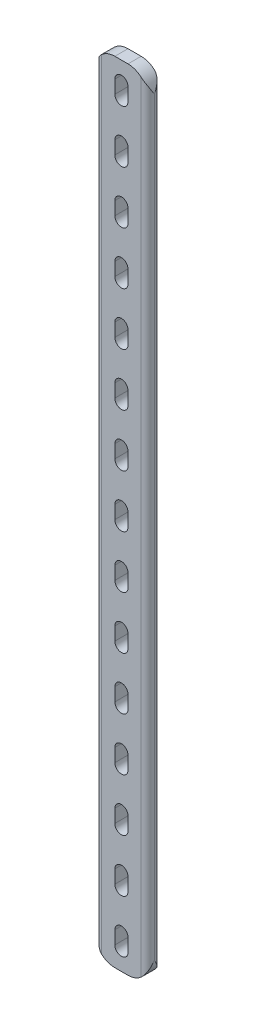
ISO-10303-21;
HEADER;
FILE_DESCRIPTION(('STEP AP214'),'2;1');
FILE_NAME('part.step','',(''),(''),'','','');
FILE_SCHEMA(('AUTOMOTIVE_DESIGN { 1 0 10303 214 1 1 1 1 }'));
ENDSEC;
DATA;
#1=APPLICATION_CONTEXT('core data for automotive mechanical design processes');
#2=APPLICATION_PROTOCOL_DEFINITION('international standard','automotive_design',2000,#1);
#3=PRODUCT_CONTEXT('',#1,'mechanical');
#4=PRODUCT('Part','Part','',(#3));
#5=PRODUCT_RELATED_PRODUCT_CATEGORY('part','',(#4));
#6=PRODUCT_DEFINITION_FORMATION('','',#4);
#7=PRODUCT_DEFINITION_CONTEXT('part definition',#1,'design');
#8=PRODUCT_DEFINITION('design','',#6,#7);
#9=PRODUCT_DEFINITION_SHAPE('','',#8);
#10=(LENGTH_UNIT() NAMED_UNIT(*) SI_UNIT(.MILLI.,.METRE.));
#11=(NAMED_UNIT(*) PLANE_ANGLE_UNIT() SI_UNIT($,.RADIAN.));
#12=(NAMED_UNIT(*) SI_UNIT($,.STERADIAN.) SOLID_ANGLE_UNIT());
#13=UNCERTAINTY_MEASURE_WITH_UNIT(LENGTH_MEASURE(1.E-05),#10,'distance_accuracy_value','');
#14=(GEOMETRIC_REPRESENTATION_CONTEXT(3) GLOBAL_UNCERTAINTY_ASSIGNED_CONTEXT((#13)) GLOBAL_UNIT_ASSIGNED_CONTEXT((#10,
#11,#12)) REPRESENTATION_CONTEXT('',''));
#15=CARTESIAN_POINT('',(0.,0.,0.));
#16=DIRECTION('',(0.,0.,1.));
#17=DIRECTION('',(1.,0.,0.));
#18=AXIS2_PLACEMENT_3D('',#15,#16,#17);
#19=CARTESIAN_POINT('',(-3.17499999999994,-149.225,0.));
#20=DIRECTION('',(-1.,0.,0.));
#21=DIRECTION('',(0.,-1.,0.));
#22=AXIS2_PLACEMENT_3D('',#19,#20,#21);
#23=PLANE('',#22);
#24=DIRECTION('',(0.,-1.,0.));
#25=VECTOR('',#24,1.);
#26=CARTESIAN_POINT('',(-3.17499999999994,-149.225,6.35));
#27=LINE('',#26,#25);
#28=CARTESIAN_POINT('',(-3.17499999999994,-149.225,6.35));
#29=VERTEX_POINT('',#28);
#30=CARTESIAN_POINT('',(-3.17499999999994,-155.575,6.35));
#31=VERTEX_POINT('',#30);
#32=EDGE_CURVE('E976',#29,#31,#27,.T.);
#33=ORIENTED_EDGE('',*,*,#32,.T.);
#34=DIRECTION('',(0.,0.,1.));
#35=VECTOR('',#34,1.);
#36=CARTESIAN_POINT('',(-3.17499999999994,-155.575,0.));
#37=LINE('',#36,#35);
#38=CARTESIAN_POINT('',(-3.17499999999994,-155.575,0.));
#39=VERTEX_POINT('',#38);
#40=EDGE_CURVE('E997',#39,#31,#37,.T.);
#41=ORIENTED_EDGE('',*,*,#40,.F.);
#42=DIRECTION('',(0.,-1.,0.));
#43=VECTOR('',#42,1.);
#44=CARTESIAN_POINT('',(-3.17499999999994,-149.225,0.));
#45=LINE('',#44,#43);
#46=CARTESIAN_POINT('',(-3.17499999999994,-149.225,0.));
#47=VERTEX_POINT('',#46);
#48=EDGE_CURVE('E981',#47,#39,#45,.T.);
#49=ORIENTED_EDGE('',*,*,#48,.F.);
#50=DIRECTION('',(0.,0.,1.));
#51=VECTOR('',#50,1.);
#52=CARTESIAN_POINT('',(-3.17499999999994,-149.225,0.));
#53=LINE('',#52,#51);
#54=EDGE_CURVE('E988',#47,#29,#53,.T.);
#55=ORIENTED_EDGE('',*,*,#54,.T.);
#56=EDGE_LOOP('',(#33,#41,#49,#55));
#57=FACE_BOUND('',#56,.T.);
#58=ADVANCED_FACE('F32',(#57),#23,.F.);
#59=CARTESIAN_POINT('',(0.,-155.575,0.));
#60=DIRECTION('',(0.,0.,1.));
#61=DIRECTION('',(1.,0.,0.));
#62=AXIS2_PLACEMENT_3D('',#59,#60,#61);
#63=CYLINDRICAL_SURFACE('',#62,3.175);
#64=CARTESIAN_POINT('',(0.,-155.575,6.35));
#65=DIRECTION('',(0.,0.,1.));
#66=DIRECTION('',(1.,0.,0.));
#67=AXIS2_PLACEMENT_3D('',#64,#65,#66);
#68=CIRCLE('',#67,3.175);
#69=CARTESIAN_POINT('',(3.17500000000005,-155.575,6.35));
#70=VERTEX_POINT('',#69);
#71=EDGE_CURVE('E973',#31,#70,#68,.T.);
#72=ORIENTED_EDGE('',*,*,#71,.T.);
#73=DIRECTION('',(0.,0.,1.));
#74=VECTOR('',#73,1.);
#75=CARTESIAN_POINT('',(3.17500000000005,-155.575,0.));
#76=LINE('',#75,#74);
#77=CARTESIAN_POINT('',(3.17500000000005,-155.575,0.));
#78=VERTEX_POINT('',#77);
#79=EDGE_CURVE('E994',#78,#70,#76,.T.);
#80=ORIENTED_EDGE('',*,*,#79,.F.);
#81=CARTESIAN_POINT('',(0.,-155.575,0.));
#82=DIRECTION('',(0.,0.,1.));
#83=DIRECTION('',(1.,0.,0.));
#84=AXIS2_PLACEMENT_3D('',#81,#82,#83);
#85=CIRCLE('',#84,3.175);
#86=EDGE_CURVE('E983',#39,#78,#85,.T.);
#87=ORIENTED_EDGE('',*,*,#86,.F.);
#88=ORIENTED_EDGE('',*,*,#40,.T.);
#89=EDGE_LOOP('',(#72,#80,#87,#88));
#90=FACE_BOUND('',#89,.T.);
#91=ADVANCED_FACE('F1062',(#90),#63,.F.);
#92=CARTESIAN_POINT('',(3.17500000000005,-149.225,0.));
#93=DIRECTION('',(1.,0.,0.));
#94=DIRECTION('',(0.,1.,0.));
#95=AXIS2_PLACEMENT_3D('',#92,#93,#94);
#96=PLANE('',#95);
#97=DIRECTION('',(0.,1.,0.));
#98=VECTOR('',#97,1.);
#99=CARTESIAN_POINT('',(3.17500000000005,-149.225,6.35));
#100=LINE('',#99,#98);
#101=CARTESIAN_POINT('',(3.17500000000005,-149.225,6.35));
#102=VERTEX_POINT('',#101);
#103=EDGE_CURVE('E970',#70,#102,#100,.T.);
#104=ORIENTED_EDGE('',*,*,#103,.T.);
#105=DIRECTION('',(0.,0.,1.));
#106=VECTOR('',#105,1.);
#107=CARTESIAN_POINT('',(3.17500000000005,-149.225,0.));
#108=LINE('',#107,#106);
#109=CARTESIAN_POINT('',(3.17500000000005,-149.225,0.));
#110=VERTEX_POINT('',#109);
#111=EDGE_CURVE('E991',#110,#102,#108,.T.);
#112=ORIENTED_EDGE('',*,*,#111,.F.);
#113=DIRECTION('',(0.,1.,0.));
#114=VECTOR('',#113,1.);
#115=CARTESIAN_POINT('',(3.17500000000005,-149.225,0.));
#116=LINE('',#115,#114);
#117=EDGE_CURVE('E985',#78,#110,#116,.T.);
#118=ORIENTED_EDGE('',*,*,#117,.F.);
#119=ORIENTED_EDGE('',*,*,#79,.T.);
#120=EDGE_LOOP('',(#104,#112,#118,#119));
#121=FACE_BOUND('',#120,.T.);
#122=ADVANCED_FACE('F1066',(#121),#96,.F.);
#123=CARTESIAN_POINT('',(0.,-149.225,0.));
#124=DIRECTION('',(0.,0.,1.));
#125=DIRECTION('',(1.,0.,0.));
#126=AXIS2_PLACEMENT_3D('',#123,#124,#125);
#127=CYLINDRICAL_SURFACE('',#126,3.175);
#128=CARTESIAN_POINT('',(0.,-149.225,6.35));
#129=DIRECTION('',(0.,0.,1.));
#130=DIRECTION('',(1.,0.,0.));
#131=AXIS2_PLACEMENT_3D('',#128,#129,#130);
#132=CIRCLE('',#131,3.175);
#133=EDGE_CURVE('E968',#102,#29,#132,.T.);
#134=ORIENTED_EDGE('',*,*,#133,.T.);
#135=ORIENTED_EDGE('',*,*,#54,.F.);
#136=CARTESIAN_POINT('',(0.,-149.225,0.));
#137=DIRECTION('',(0.,0.,1.));
#138=DIRECTION('',(1.,0.,0.));
#139=AXIS2_PLACEMENT_3D('',#136,#137,#138);
#140=CIRCLE('',#139,3.175);
#141=EDGE_CURVE('E979',#110,#47,#140,.T.);
#142=ORIENTED_EDGE('',*,*,#141,.F.);
#143=ORIENTED_EDGE('',*,*,#111,.T.);
#144=EDGE_LOOP('',(#134,#135,#142,#143));
#145=FACE_BOUND('',#144,.T.);
#146=ADVANCED_FACE('F1070',(#145),#127,.F.);
#147=CARTESIAN_POINT('',(-3.17499999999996,-123.825,0.));
#148=DIRECTION('',(-1.,0.,0.));
#149=DIRECTION('',(0.,-1.,0.));
#150=AXIS2_PLACEMENT_3D('',#147,#148,#149);
#151=PLANE('',#150);
#152=DIRECTION('',(0.,-1.,0.));
#153=VECTOR('',#152,1.);
#154=CARTESIAN_POINT('',(-3.17499999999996,-123.825,6.35));
#155=LINE('',#154,#153);
#156=CARTESIAN_POINT('',(-3.17499999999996,-123.825,6.35));
#157=VERTEX_POINT('',#156);
#158=CARTESIAN_POINT('',(-3.17499999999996,-130.175,6.35));
#159=VERTEX_POINT('',#158);
#160=EDGE_CURVE('E944',#157,#159,#155,.T.);
#161=ORIENTED_EDGE('',*,*,#160,.T.);
#162=DIRECTION('',(0.,0.,1.));
#163=VECTOR('',#162,1.);
#164=CARTESIAN_POINT('',(-3.17499999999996,-130.175,0.));
#165=LINE('',#164,#163);
#166=CARTESIAN_POINT('',(-3.17499999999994,-130.175,0.));
#167=VERTEX_POINT('',#166);
#168=EDGE_CURVE('E965',#167,#159,#165,.T.);
#169=ORIENTED_EDGE('',*,*,#168,.F.);
#170=DIRECTION('',(0.,-1.,0.));
#171=VECTOR('',#170,1.);
#172=CARTESIAN_POINT('',(-3.17499999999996,-123.825,0.));
#173=LINE('',#172,#171);
#174=CARTESIAN_POINT('',(-3.17499999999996,-123.825,0.));
#175=VERTEX_POINT('',#174);
#176=EDGE_CURVE('E949',#175,#167,#173,.T.);
#177=ORIENTED_EDGE('',*,*,#176,.F.);
#178=DIRECTION('',(0.,0.,1.));
#179=VECTOR('',#178,1.);
#180=CARTESIAN_POINT('',(-3.17499999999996,-123.825,0.));
#181=LINE('',#180,#179);
#182=EDGE_CURVE('E956',#175,#157,#181,.T.);
#183=ORIENTED_EDGE('',*,*,#182,.T.);
#184=EDGE_LOOP('',(#161,#169,#177,#183));
#185=FACE_BOUND('',#184,.T.);
#186=ADVANCED_FACE('F1074',(#185),#151,.F.);
#187=CARTESIAN_POINT('',(0.,-130.175,0.));
#188=DIRECTION('',(0.,0.,1.));
#189=DIRECTION('',(1.,0.,0.));
#190=AXIS2_PLACEMENT_3D('',#187,#188,#189);
#191=CYLINDRICAL_SURFACE('',#190,3.175);
#192=CARTESIAN_POINT('',(0.,-130.175,6.35));
#193=DIRECTION('',(0.,0.,1.));
#194=DIRECTION('',(1.,0.,0.));
#195=AXIS2_PLACEMENT_3D('',#192,#193,#194);
#196=CIRCLE('',#195,3.175);
#197=CARTESIAN_POINT('',(3.17500000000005,-130.175,6.35));
#198=VERTEX_POINT('',#197);
#199=EDGE_CURVE('E941',#159,#198,#196,.T.);
#200=ORIENTED_EDGE('',*,*,#199,.T.);
#201=DIRECTION('',(0.,0.,1.));
#202=VECTOR('',#201,1.);
#203=CARTESIAN_POINT('',(3.17500000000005,-130.175,0.));
#204=LINE('',#203,#202);
#205=CARTESIAN_POINT('',(3.17500000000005,-130.175,0.));
#206=VERTEX_POINT('',#205);
#207=EDGE_CURVE('E962',#206,#198,#204,.T.);
#208=ORIENTED_EDGE('',*,*,#207,.F.);
#209=CARTESIAN_POINT('',(0.,-130.175,0.));
#210=DIRECTION('',(0.,0.,1.));
#211=DIRECTION('',(1.,0.,0.));
#212=AXIS2_PLACEMENT_3D('',#209,#210,#211);
#213=CIRCLE('',#212,3.175);
#214=EDGE_CURVE('E951',#167,#206,#213,.T.);
#215=ORIENTED_EDGE('',*,*,#214,.F.);
#216=ORIENTED_EDGE('',*,*,#168,.T.);
#217=EDGE_LOOP('',(#200,#208,#215,#216));
#218=FACE_BOUND('',#217,.T.);
#219=ADVANCED_FACE('F1078',(#218),#191,.F.);
#220=CARTESIAN_POINT('',(3.17500000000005,-123.825,0.));
#221=DIRECTION('',(1.,0.,0.));
#222=DIRECTION('',(0.,1.,0.));
#223=AXIS2_PLACEMENT_3D('',#220,#221,#222);
#224=PLANE('',#223);
#225=DIRECTION('',(0.,1.,0.));
#226=VECTOR('',#225,1.);
#227=CARTESIAN_POINT('',(3.17500000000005,-123.825,6.35));
#228=LINE('',#227,#226);
#229=CARTESIAN_POINT('',(3.17500000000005,-123.825,6.35));
#230=VERTEX_POINT('',#229);
#231=EDGE_CURVE('E938',#198,#230,#228,.T.);
#232=ORIENTED_EDGE('',*,*,#231,.T.);
#233=DIRECTION('',(0.,0.,1.));
#234=VECTOR('',#233,1.);
#235=CARTESIAN_POINT('',(3.17500000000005,-123.825,0.));
#236=LINE('',#235,#234);
#237=CARTESIAN_POINT('',(3.17500000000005,-123.825,0.));
#238=VERTEX_POINT('',#237);
#239=EDGE_CURVE('E959',#238,#230,#236,.T.);
#240=ORIENTED_EDGE('',*,*,#239,.F.);
#241=DIRECTION('',(0.,1.,0.));
#242=VECTOR('',#241,1.);
#243=CARTESIAN_POINT('',(3.17500000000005,-123.825,0.));
#244=LINE('',#243,#242);
#245=EDGE_CURVE('E953',#206,#238,#244,.T.);
#246=ORIENTED_EDGE('',*,*,#245,.F.);
#247=ORIENTED_EDGE('',*,*,#207,.T.);
#248=EDGE_LOOP('',(#232,#240,#246,#247));
#249=FACE_BOUND('',#248,.T.);
#250=ADVANCED_FACE('F1082',(#249),#224,.F.);
#251=CARTESIAN_POINT('',(0.,-123.825,0.));
#252=DIRECTION('',(0.,0.,1.));
#253=DIRECTION('',(1.,0.,0.));
#254=AXIS2_PLACEMENT_3D('',#251,#252,#253);
#255=CYLINDRICAL_SURFACE('',#254,3.175);
#256=CARTESIAN_POINT('',(0.,-123.825,6.35));
#257=DIRECTION('',(0.,0.,1.));
#258=DIRECTION('',(1.,0.,0.));
#259=AXIS2_PLACEMENT_3D('',#256,#257,#258);
#260=CIRCLE('',#259,3.175);
#261=EDGE_CURVE('E936',#230,#157,#260,.T.);
#262=ORIENTED_EDGE('',*,*,#261,.T.);
#263=ORIENTED_EDGE('',*,*,#182,.F.);
#264=CARTESIAN_POINT('',(0.,-123.825,0.));
#265=DIRECTION('',(0.,0.,1.));
#266=DIRECTION('',(1.,0.,0.));
#267=AXIS2_PLACEMENT_3D('',#264,#265,#266);
#268=CIRCLE('',#267,3.175);
#269=EDGE_CURVE('E947',#238,#175,#268,.T.);
#270=ORIENTED_EDGE('',*,*,#269,.F.);
#271=ORIENTED_EDGE('',*,*,#239,.T.);
#272=EDGE_LOOP('',(#262,#263,#270,#271));
#273=FACE_BOUND('',#272,.T.);
#274=ADVANCED_FACE('F1086',(#273),#255,.F.);
#275=CARTESIAN_POINT('',(-3.17499999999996,-98.425,0.));
#276=DIRECTION('',(-1.,0.,0.));
#277=DIRECTION('',(0.,-1.,0.));
#278=AXIS2_PLACEMENT_3D('',#275,#276,#277);
#279=PLANE('',#278);
#280=DIRECTION('',(0.,-1.,0.));
#281=VECTOR('',#280,1.);
#282=CARTESIAN_POINT('',(-3.17499999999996,-98.425,6.35));
#283=LINE('',#282,#281);
#284=CARTESIAN_POINT('',(-3.17499999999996,-98.4249999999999,6.35));
#285=VERTEX_POINT('',#284);
#286=CARTESIAN_POINT('',(-3.17499999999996,-104.775,6.35));
#287=VERTEX_POINT('',#286);
#288=EDGE_CURVE('E912',#285,#287,#283,.T.);
#289=ORIENTED_EDGE('',*,*,#288,.T.);
#290=DIRECTION('',(0.,0.,1.));
#291=VECTOR('',#290,1.);
#292=CARTESIAN_POINT('',(-3.17499999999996,-104.775,0.));
#293=LINE('',#292,#291);
#294=CARTESIAN_POINT('',(-3.17499999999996,-104.775,0.));
#295=VERTEX_POINT('',#294);
#296=EDGE_CURVE('E933',#295,#287,#293,.T.);
#297=ORIENTED_EDGE('',*,*,#296,.F.);
#298=DIRECTION('',(0.,-1.,0.));
#299=VECTOR('',#298,1.);
#300=CARTESIAN_POINT('',(-3.17499999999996,-98.425,0.));
#301=LINE('',#300,#299);
#302=CARTESIAN_POINT('',(-3.17499999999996,-98.425,0.));
#303=VERTEX_POINT('',#302);
#304=EDGE_CURVE('E917',#303,#295,#301,.T.);
#305=ORIENTED_EDGE('',*,*,#304,.F.);
#306=DIRECTION('',(0.,0.,1.));
#307=VECTOR('',#306,1.);
#308=CARTESIAN_POINT('',(-3.17499999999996,-98.425,0.));
#309=LINE('',#308,#307);
#310=EDGE_CURVE('E924',#303,#285,#309,.T.);
#311=ORIENTED_EDGE('',*,*,#310,.T.);
#312=EDGE_LOOP('',(#289,#297,#305,#311));
#313=FACE_BOUND('',#312,.T.);
#314=ADVANCED_FACE('F1090',(#313),#279,.F.);
#315=CARTESIAN_POINT('',(0.,-104.775,0.));
#316=DIRECTION('',(0.,0.,1.));
#317=DIRECTION('',(1.,0.,0.));
#318=AXIS2_PLACEMENT_3D('',#315,#316,#317);
#319=CYLINDRICAL_SURFACE('',#318,3.175);
#320=CARTESIAN_POINT('',(0.,-104.775,6.35));
#321=DIRECTION('',(0.,0.,1.));
#322=DIRECTION('',(1.,0.,0.));
#323=AXIS2_PLACEMENT_3D('',#320,#321,#322);
#324=CIRCLE('',#323,3.175);
#325=CARTESIAN_POINT('',(3.17500000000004,-104.775,6.35));
#326=VERTEX_POINT('',#325);
#327=EDGE_CURVE('E909',#287,#326,#324,.T.);
#328=ORIENTED_EDGE('',*,*,#327,.T.);
#329=DIRECTION('',(0.,0.,1.));
#330=VECTOR('',#329,1.);
#331=CARTESIAN_POINT('',(3.17500000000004,-104.775,0.));
#332=LINE('',#331,#330);
#333=CARTESIAN_POINT('',(3.17500000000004,-104.775,0.));
#334=VERTEX_POINT('',#333);
#335=EDGE_CURVE('E930',#334,#326,#332,.T.);
#336=ORIENTED_EDGE('',*,*,#335,.F.);
#337=CARTESIAN_POINT('',(0.,-104.775,0.));
#338=DIRECTION('',(0.,0.,1.));
#339=DIRECTION('',(1.,0.,0.));
#340=AXIS2_PLACEMENT_3D('',#337,#338,#339);
#341=CIRCLE('',#340,3.175);
#342=EDGE_CURVE('E919',#295,#334,#341,.T.);
#343=ORIENTED_EDGE('',*,*,#342,.F.);
#344=ORIENTED_EDGE('',*,*,#296,.T.);
#345=EDGE_LOOP('',(#328,#336,#343,#344));
#346=FACE_BOUND('',#345,.T.);
#347=ADVANCED_FACE('F1094',(#346),#319,.F.);
#348=CARTESIAN_POINT('',(3.17500000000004,-98.425,0.));
#349=DIRECTION('',(1.,0.,0.));
#350=DIRECTION('',(0.,1.,0.));
#351=AXIS2_PLACEMENT_3D('',#348,#349,#350);
#352=PLANE('',#351);
#353=DIRECTION('',(0.,1.,0.));
#354=VECTOR('',#353,1.);
#355=CARTESIAN_POINT('',(3.17500000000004,-98.425,6.35));
#356=LINE('',#355,#354);
#357=CARTESIAN_POINT('',(3.17500000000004,-98.425,6.35));
#358=VERTEX_POINT('',#357);
#359=EDGE_CURVE('E906',#326,#358,#356,.T.);
#360=ORIENTED_EDGE('',*,*,#359,.T.);
#361=DIRECTION('',(0.,0.,1.));
#362=VECTOR('',#361,1.);
#363=CARTESIAN_POINT('',(3.17500000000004,-98.425,0.));
#364=LINE('',#363,#362);
#365=CARTESIAN_POINT('',(3.17500000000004,-98.425,0.));
#366=VERTEX_POINT('',#365);
#367=EDGE_CURVE('E927',#366,#358,#364,.T.);
#368=ORIENTED_EDGE('',*,*,#367,.F.);
#369=DIRECTION('',(0.,1.,0.));
#370=VECTOR('',#369,1.);
#371=CARTESIAN_POINT('',(3.17500000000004,-98.425,0.));
#372=LINE('',#371,#370);
#373=EDGE_CURVE('E921',#334,#366,#372,.T.);
#374=ORIENTED_EDGE('',*,*,#373,.F.);
#375=ORIENTED_EDGE('',*,*,#335,.T.);
#376=EDGE_LOOP('',(#360,#368,#374,#375));
#377=FACE_BOUND('',#376,.T.);
#378=ADVANCED_FACE('F1098',(#377),#352,.F.);
#379=CARTESIAN_POINT('',(0.,-98.425,0.));
#380=DIRECTION('',(0.,0.,1.));
#381=DIRECTION('',(1.,0.,0.));
#382=AXIS2_PLACEMENT_3D('',#379,#380,#381);
#383=CYLINDRICAL_SURFACE('',#382,3.175);
#384=CARTESIAN_POINT('',(0.,-98.425,6.35));
#385=DIRECTION('',(0.,0.,1.));
#386=DIRECTION('',(1.,0.,0.));
#387=AXIS2_PLACEMENT_3D('',#384,#385,#386);
#388=CIRCLE('',#387,3.175);
#389=EDGE_CURVE('E904',#358,#285,#388,.T.);
#390=ORIENTED_EDGE('',*,*,#389,.T.);
#391=ORIENTED_EDGE('',*,*,#310,.F.);
#392=CARTESIAN_POINT('',(0.,-98.425,0.));
#393=DIRECTION('',(0.,0.,1.));
#394=DIRECTION('',(1.,0.,0.));
#395=AXIS2_PLACEMENT_3D('',#392,#393,#394);
#396=CIRCLE('',#395,3.175);
#397=EDGE_CURVE('E915',#366,#303,#396,.T.);
#398=ORIENTED_EDGE('',*,*,#397,.F.);
#399=ORIENTED_EDGE('',*,*,#367,.T.);
#400=EDGE_LOOP('',(#390,#391,#398,#399));
#401=FACE_BOUND('',#400,.T.);
#402=ADVANCED_FACE('F1102',(#401),#383,.F.);
#403=CARTESIAN_POINT('',(-3.17499999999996,-73.025,0.));
#404=DIRECTION('',(-1.,0.,0.));
#405=DIRECTION('',(0.,-1.,0.));
#406=AXIS2_PLACEMENT_3D('',#403,#404,#405);
#407=PLANE('',#406);
#408=DIRECTION('',(0.,-1.,0.));
#409=VECTOR('',#408,1.);
#410=CARTESIAN_POINT('',(-3.17499999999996,-73.025,6.35));
#411=LINE('',#410,#409);
#412=CARTESIAN_POINT('',(-3.17499999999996,-73.0249999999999,6.35));
#413=VERTEX_POINT('',#412);
#414=CARTESIAN_POINT('',(-3.17499999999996,-79.375,6.35));
#415=VERTEX_POINT('',#414);
#416=EDGE_CURVE('E880',#413,#415,#411,.T.);
#417=ORIENTED_EDGE('',*,*,#416,.T.);
#418=DIRECTION('',(0.,0.,1.));
#419=VECTOR('',#418,1.);
#420=CARTESIAN_POINT('',(-3.17499999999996,-79.375,0.));
#421=LINE('',#420,#419);
#422=CARTESIAN_POINT('',(-3.17499999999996,-79.375,0.));
#423=VERTEX_POINT('',#422);
#424=EDGE_CURVE('E901',#423,#415,#421,.T.);
#425=ORIENTED_EDGE('',*,*,#424,.F.);
#426=DIRECTION('',(0.,-1.,0.));
#427=VECTOR('',#426,1.);
#428=CARTESIAN_POINT('',(-3.17499999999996,-73.025,0.));
#429=LINE('',#428,#427);
#430=CARTESIAN_POINT('',(-3.17499999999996,-73.025,0.));
#431=VERTEX_POINT('',#430);
#432=EDGE_CURVE('E885',#431,#423,#429,.T.);
#433=ORIENTED_EDGE('',*,*,#432,.F.);
#434=DIRECTION('',(0.,0.,1.));
#435=VECTOR('',#434,1.);
#436=CARTESIAN_POINT('',(-3.17499999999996,-73.025,0.));
#437=LINE('',#436,#435);
#438=EDGE_CURVE('E892',#431,#413,#437,.T.);
#439=ORIENTED_EDGE('',*,*,#438,.T.);
#440=EDGE_LOOP('',(#417,#425,#433,#439));
#441=FACE_BOUND('',#440,.T.);
#442=ADVANCED_FACE('F1106',(#441),#407,.F.);
#443=CARTESIAN_POINT('',(0.,-79.375,0.));
#444=DIRECTION('',(0.,0.,1.));
#445=DIRECTION('',(1.,0.,0.));
#446=AXIS2_PLACEMENT_3D('',#443,#444,#445);
#447=CYLINDRICAL_SURFACE('',#446,3.175);
#448=CARTESIAN_POINT('',(0.,-79.375,6.35));
#449=DIRECTION('',(0.,0.,1.));
#450=DIRECTION('',(1.,0.,0.));
#451=AXIS2_PLACEMENT_3D('',#448,#449,#450);
#452=CIRCLE('',#451,3.175);
#453=CARTESIAN_POINT('',(3.17500000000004,-79.375,6.35));
#454=VERTEX_POINT('',#453);
#455=EDGE_CURVE('E877',#415,#454,#452,.T.);
#456=ORIENTED_EDGE('',*,*,#455,.T.);
#457=DIRECTION('',(0.,0.,1.));
#458=VECTOR('',#457,1.);
#459=CARTESIAN_POINT('',(3.17500000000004,-79.375,0.));
#460=LINE('',#459,#458);
#461=CARTESIAN_POINT('',(3.17500000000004,-79.375,0.));
#462=VERTEX_POINT('',#461);
#463=EDGE_CURVE('E898',#462,#454,#460,.T.);
#464=ORIENTED_EDGE('',*,*,#463,.F.);
#465=CARTESIAN_POINT('',(0.,-79.375,0.));
#466=DIRECTION('',(0.,0.,1.));
#467=DIRECTION('',(1.,0.,0.));
#468=AXIS2_PLACEMENT_3D('',#465,#466,#467);
#469=CIRCLE('',#468,3.175);
#470=EDGE_CURVE('E887',#423,#462,#469,.T.);
#471=ORIENTED_EDGE('',*,*,#470,.F.);
#472=ORIENTED_EDGE('',*,*,#424,.T.);
#473=EDGE_LOOP('',(#456,#464,#471,#472));
#474=FACE_BOUND('',#473,.T.);
#475=ADVANCED_FACE('F1110',(#474),#447,.F.);
#476=CARTESIAN_POINT('',(3.17500000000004,-73.025,0.));
#477=DIRECTION('',(1.,0.,0.));
#478=DIRECTION('',(0.,1.,0.));
#479=AXIS2_PLACEMENT_3D('',#476,#477,#478);
#480=PLANE('',#479);
#481=DIRECTION('',(0.,1.,0.));
#482=VECTOR('',#481,1.);
#483=CARTESIAN_POINT('',(3.17500000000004,-73.025,6.35));
#484=LINE('',#483,#482);
#485=CARTESIAN_POINT('',(3.17500000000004,-73.025,6.35));
#486=VERTEX_POINT('',#485);
#487=EDGE_CURVE('E874',#454,#486,#484,.T.);
#488=ORIENTED_EDGE('',*,*,#487,.T.);
#489=DIRECTION('',(0.,0.,1.));
#490=VECTOR('',#489,1.);
#491=CARTESIAN_POINT('',(3.17500000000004,-73.025,0.));
#492=LINE('',#491,#490);
#493=CARTESIAN_POINT('',(3.17500000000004,-73.025,0.));
#494=VERTEX_POINT('',#493);
#495=EDGE_CURVE('E895',#494,#486,#492,.T.);
#496=ORIENTED_EDGE('',*,*,#495,.F.);
#497=DIRECTION('',(0.,1.,0.));
#498=VECTOR('',#497,1.);
#499=CARTESIAN_POINT('',(3.17500000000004,-73.025,0.));
#500=LINE('',#499,#498);
#501=EDGE_CURVE('E889',#462,#494,#500,.T.);
#502=ORIENTED_EDGE('',*,*,#501,.F.);
#503=ORIENTED_EDGE('',*,*,#463,.T.);
#504=EDGE_LOOP('',(#488,#496,#502,#503));
#505=FACE_BOUND('',#504,.T.);
#506=ADVANCED_FACE('F1114',(#505),#480,.F.);
#507=CARTESIAN_POINT('',(0.,-73.025,0.));
#508=DIRECTION('',(0.,0.,1.));
#509=DIRECTION('',(1.,0.,0.));
#510=AXIS2_PLACEMENT_3D('',#507,#508,#509);
#511=CYLINDRICAL_SURFACE('',#510,3.175);
#512=CARTESIAN_POINT('',(0.,-73.025,6.35));
#513=DIRECTION('',(0.,0.,1.));
#514=DIRECTION('',(1.,0.,0.));
#515=AXIS2_PLACEMENT_3D('',#512,#513,#514);
#516=CIRCLE('',#515,3.175);
#517=EDGE_CURVE('E872',#486,#413,#516,.T.);
#518=ORIENTED_EDGE('',*,*,#517,.T.);
#519=ORIENTED_EDGE('',*,*,#438,.F.);
#520=CARTESIAN_POINT('',(0.,-73.025,0.));
#521=DIRECTION('',(0.,0.,1.));
#522=DIRECTION('',(1.,0.,0.));
#523=AXIS2_PLACEMENT_3D('',#520,#521,#522);
#524=CIRCLE('',#523,3.175);
#525=EDGE_CURVE('E883',#494,#431,#524,.T.);
#526=ORIENTED_EDGE('',*,*,#525,.F.);
#527=ORIENTED_EDGE('',*,*,#495,.T.);
#528=EDGE_LOOP('',(#518,#519,#526,#527));
#529=FACE_BOUND('',#528,.T.);
#530=ADVANCED_FACE('F1118',(#529),#511,.F.);
#531=CARTESIAN_POINT('',(-3.17499999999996,-47.625,0.));
#532=DIRECTION('',(-1.,0.,0.));
#533=DIRECTION('',(0.,-1.,0.));
#534=AXIS2_PLACEMENT_3D('',#531,#532,#533);
#535=PLANE('',#534);
#536=DIRECTION('',(0.,-1.,0.));
#537=VECTOR('',#536,1.);
#538=CARTESIAN_POINT('',(-3.17499999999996,-47.625,6.35));
#539=LINE('',#538,#537);
#540=CARTESIAN_POINT('',(-3.17499999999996,-47.6249999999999,6.35));
#541=VERTEX_POINT('',#540);
#542=CARTESIAN_POINT('',(-3.17499999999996,-53.975,6.35));
#543=VERTEX_POINT('',#542);
#544=EDGE_CURVE('E848',#541,#543,#539,.T.);
#545=ORIENTED_EDGE('',*,*,#544,.T.);
#546=DIRECTION('',(0.,0.,1.));
#547=VECTOR('',#546,1.);
#548=CARTESIAN_POINT('',(-3.17499999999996,-53.975,0.));
#549=LINE('',#548,#547);
#550=CARTESIAN_POINT('',(-3.17499999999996,-53.975,0.));
#551=VERTEX_POINT('',#550);
#552=EDGE_CURVE('E869',#551,#543,#549,.T.);
#553=ORIENTED_EDGE('',*,*,#552,.F.);
#554=DIRECTION('',(0.,-1.,0.));
#555=VECTOR('',#554,1.);
#556=CARTESIAN_POINT('',(-3.17499999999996,-47.625,0.));
#557=LINE('',#556,#555);
#558=CARTESIAN_POINT('',(-3.17499999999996,-47.625,0.));
#559=VERTEX_POINT('',#558);
#560=EDGE_CURVE('E853',#559,#551,#557,.T.);
#561=ORIENTED_EDGE('',*,*,#560,.F.);
#562=DIRECTION('',(0.,0.,1.));
#563=VECTOR('',#562,1.);
#564=CARTESIAN_POINT('',(-3.17499999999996,-47.625,0.));
#565=LINE('',#564,#563);
#566=EDGE_CURVE('E860',#559,#541,#565,.T.);
#567=ORIENTED_EDGE('',*,*,#566,.T.);
#568=EDGE_LOOP('',(#545,#553,#561,#567));
#569=FACE_BOUND('',#568,.T.);
#570=ADVANCED_FACE('F1122',(#569),#535,.F.);
#571=CARTESIAN_POINT('',(0.,-53.975,0.));
#572=DIRECTION('',(0.,0.,1.));
#573=DIRECTION('',(1.,0.,0.));
#574=AXIS2_PLACEMENT_3D('',#571,#572,#573);
#575=CYLINDRICAL_SURFACE('',#574,3.175);
#576=CARTESIAN_POINT('',(0.,-53.975,6.35));
#577=DIRECTION('',(0.,0.,1.));
#578=DIRECTION('',(1.,0.,0.));
#579=AXIS2_PLACEMENT_3D('',#576,#577,#578);
#580=CIRCLE('',#579,3.175);
#581=CARTESIAN_POINT('',(3.17500000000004,-53.975,6.35));
#582=VERTEX_POINT('',#581);
#583=EDGE_CURVE('E845',#543,#582,#580,.T.);
#584=ORIENTED_EDGE('',*,*,#583,.T.);
#585=DIRECTION('',(0.,0.,1.));
#586=VECTOR('',#585,1.);
#587=CARTESIAN_POINT('',(3.17500000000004,-53.975,0.));
#588=LINE('',#587,#586);
#589=CARTESIAN_POINT('',(3.17500000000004,-53.975,0.));
#590=VERTEX_POINT('',#589);
#591=EDGE_CURVE('E866',#590,#582,#588,.T.);
#592=ORIENTED_EDGE('',*,*,#591,.F.);
#593=CARTESIAN_POINT('',(0.,-53.975,0.));
#594=DIRECTION('',(0.,0.,1.));
#595=DIRECTION('',(1.,0.,0.));
#596=AXIS2_PLACEMENT_3D('',#593,#594,#595);
#597=CIRCLE('',#596,3.175);
#598=EDGE_CURVE('E855',#551,#590,#597,.T.);
#599=ORIENTED_EDGE('',*,*,#598,.F.);
#600=ORIENTED_EDGE('',*,*,#552,.T.);
#601=EDGE_LOOP('',(#584,#592,#599,#600));
#602=FACE_BOUND('',#601,.T.);
#603=ADVANCED_FACE('F1126',(#602),#575,.F.);
#604=CARTESIAN_POINT('',(3.17500000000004,-47.625,0.));
#605=DIRECTION('',(1.,0.,0.));
#606=DIRECTION('',(0.,1.,0.));
#607=AXIS2_PLACEMENT_3D('',#604,#605,#606);
#608=PLANE('',#607);
#609=DIRECTION('',(0.,1.,0.));
#610=VECTOR('',#609,1.);
#611=CARTESIAN_POINT('',(3.17500000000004,-47.625,6.35));
#612=LINE('',#611,#610);
#613=CARTESIAN_POINT('',(3.17500000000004,-47.625,6.35));
#614=VERTEX_POINT('',#613);
#615=EDGE_CURVE('E842',#582,#614,#612,.T.);
#616=ORIENTED_EDGE('',*,*,#615,.T.);
#617=DIRECTION('',(0.,0.,1.));
#618=VECTOR('',#617,1.);
#619=CARTESIAN_POINT('',(3.17500000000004,-47.625,0.));
#620=LINE('',#619,#618);
#621=CARTESIAN_POINT('',(3.17500000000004,-47.625,0.));
#622=VERTEX_POINT('',#621);
#623=EDGE_CURVE('E863',#622,#614,#620,.T.);
#624=ORIENTED_EDGE('',*,*,#623,.F.);
#625=DIRECTION('',(0.,1.,0.));
#626=VECTOR('',#625,1.);
#627=CARTESIAN_POINT('',(3.17500000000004,-47.625,0.));
#628=LINE('',#627,#626);
#629=EDGE_CURVE('E857',#590,#622,#628,.T.);
#630=ORIENTED_EDGE('',*,*,#629,.F.);
#631=ORIENTED_EDGE('',*,*,#591,.T.);
#632=EDGE_LOOP('',(#616,#624,#630,#631));
#633=FACE_BOUND('',#632,.T.);
#634=ADVANCED_FACE('F1130',(#633),#608,.F.);
#635=CARTESIAN_POINT('',(0.,-47.625,0.));
#636=DIRECTION('',(0.,0.,1.));
#637=DIRECTION('',(1.,0.,0.));
#638=AXIS2_PLACEMENT_3D('',#635,#636,#637);
#639=CYLINDRICAL_SURFACE('',#638,3.175);
#640=CARTESIAN_POINT('',(0.,-47.625,6.35));
#641=DIRECTION('',(0.,0.,1.));
#642=DIRECTION('',(1.,0.,0.));
#643=AXIS2_PLACEMENT_3D('',#640,#641,#642);
#644=CIRCLE('',#643,3.175);
#645=EDGE_CURVE('E840',#614,#541,#644,.T.);
#646=ORIENTED_EDGE('',*,*,#645,.T.);
#647=ORIENTED_EDGE('',*,*,#566,.F.);
#648=CARTESIAN_POINT('',(0.,-47.625,0.));
#649=DIRECTION('',(0.,0.,1.));
#650=DIRECTION('',(1.,0.,0.));
#651=AXIS2_PLACEMENT_3D('',#648,#649,#650);
#652=CIRCLE('',#651,3.175);
#653=EDGE_CURVE('E851',#622,#559,#652,.T.);
#654=ORIENTED_EDGE('',*,*,#653,.F.);
#655=ORIENTED_EDGE('',*,*,#623,.T.);
#656=EDGE_LOOP('',(#646,#647,#654,#655));
#657=FACE_BOUND('',#656,.T.);
#658=ADVANCED_FACE('F1134',(#657),#639,.F.);
#659=CARTESIAN_POINT('',(-3.17499999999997,-22.225,0.));
#660=DIRECTION('',(-1.,0.,0.));
#661=DIRECTION('',(0.,-1.,0.));
#662=AXIS2_PLACEMENT_3D('',#659,#660,#661);
#663=PLANE('',#662);
#664=DIRECTION('',(0.,-1.,0.));
#665=VECTOR('',#664,1.);
#666=CARTESIAN_POINT('',(-3.17499999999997,-22.225,6.35));
#667=LINE('',#666,#665);
#668=CARTESIAN_POINT('',(-3.17499999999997,-22.2249999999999,6.35));
#669=VERTEX_POINT('',#668);
#670=CARTESIAN_POINT('',(-3.17499999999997,-28.575,6.35));
#671=VERTEX_POINT('',#670);
#672=EDGE_CURVE('E816',#669,#671,#667,.T.);
#673=ORIENTED_EDGE('',*,*,#672,.T.);
#674=DIRECTION('',(0.,0.,1.));
#675=VECTOR('',#674,1.);
#676=CARTESIAN_POINT('',(-3.17499999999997,-28.575,0.));
#677=LINE('',#676,#675);
#678=CARTESIAN_POINT('',(-3.17499999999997,-28.575,0.));
#679=VERTEX_POINT('',#678);
#680=EDGE_CURVE('E837',#679,#671,#677,.T.);
#681=ORIENTED_EDGE('',*,*,#680,.F.);
#682=DIRECTION('',(0.,-1.,0.));
#683=VECTOR('',#682,1.);
#684=CARTESIAN_POINT('',(-3.17499999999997,-22.225,0.));
#685=LINE('',#684,#683);
#686=CARTESIAN_POINT('',(-3.17499999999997,-22.225,0.));
#687=VERTEX_POINT('',#686);
#688=EDGE_CURVE('E821',#687,#679,#685,.T.);
#689=ORIENTED_EDGE('',*,*,#688,.F.);
#690=DIRECTION('',(0.,0.,1.));
#691=VECTOR('',#690,1.);
#692=CARTESIAN_POINT('',(-3.17499999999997,-22.225,0.));
#693=LINE('',#692,#691);
#694=EDGE_CURVE('E828',#687,#669,#693,.T.);
#695=ORIENTED_EDGE('',*,*,#694,.T.);
#696=EDGE_LOOP('',(#673,#681,#689,#695));
#697=FACE_BOUND('',#696,.T.);
#698=ADVANCED_FACE('F1138',(#697),#663,.F.);
#699=CARTESIAN_POINT('',(0.,-28.575,0.));
#700=DIRECTION('',(0.,0.,1.));
#701=DIRECTION('',(1.,0.,0.));
#702=AXIS2_PLACEMENT_3D('',#699,#700,#701);
#703=CYLINDRICAL_SURFACE('',#702,3.175);
#704=CARTESIAN_POINT('',(0.,-28.575,6.35));
#705=DIRECTION('',(0.,0.,1.));
#706=DIRECTION('',(1.,0.,0.));
#707=AXIS2_PLACEMENT_3D('',#704,#705,#706);
#708=CIRCLE('',#707,3.175);
#709=CARTESIAN_POINT('',(3.17500000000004,-28.575,6.35));
#710=VERTEX_POINT('',#709);
#711=EDGE_CURVE('E813',#671,#710,#708,.T.);
#712=ORIENTED_EDGE('',*,*,#711,.T.);
#713=DIRECTION('',(0.,0.,1.));
#714=VECTOR('',#713,1.);
#715=CARTESIAN_POINT('',(3.17500000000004,-28.575,0.));
#716=LINE('',#715,#714);
#717=CARTESIAN_POINT('',(3.17500000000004,-28.575,0.));
#718=VERTEX_POINT('',#717);
#719=EDGE_CURVE('E834',#718,#710,#716,.T.);
#720=ORIENTED_EDGE('',*,*,#719,.F.);
#721=CARTESIAN_POINT('',(0.,-28.575,0.));
#722=DIRECTION('',(0.,0.,1.));
#723=DIRECTION('',(1.,0.,0.));
#724=AXIS2_PLACEMENT_3D('',#721,#722,#723);
#725=CIRCLE('',#724,3.175);
#726=EDGE_CURVE('E823',#679,#718,#725,.T.);
#727=ORIENTED_EDGE('',*,*,#726,.F.);
#728=ORIENTED_EDGE('',*,*,#680,.T.);
#729=EDGE_LOOP('',(#712,#720,#727,#728));
#730=FACE_BOUND('',#729,.T.);
#731=ADVANCED_FACE('F1142',(#730),#703,.F.);
#732=CARTESIAN_POINT('',(3.17500000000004,-22.225,0.));
#733=DIRECTION('',(1.,0.,0.));
#734=DIRECTION('',(0.,1.,0.));
#735=AXIS2_PLACEMENT_3D('',#732,#733,#734);
#736=PLANE('',#735);
#737=DIRECTION('',(0.,1.,0.));
#738=VECTOR('',#737,1.);
#739=CARTESIAN_POINT('',(3.17500000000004,-22.225,6.35));
#740=LINE('',#739,#738);
#741=CARTESIAN_POINT('',(3.17500000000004,-22.225,6.35));
#742=VERTEX_POINT('',#741);
#743=EDGE_CURVE('E810',#710,#742,#740,.T.);
#744=ORIENTED_EDGE('',*,*,#743,.T.);
#745=DIRECTION('',(0.,0.,1.));
#746=VECTOR('',#745,1.);
#747=CARTESIAN_POINT('',(3.17500000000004,-22.225,0.));
#748=LINE('',#747,#746);
#749=CARTESIAN_POINT('',(3.17500000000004,-22.225,0.));
#750=VERTEX_POINT('',#749);
#751=EDGE_CURVE('E831',#750,#742,#748,.T.);
#752=ORIENTED_EDGE('',*,*,#751,.F.);
#753=DIRECTION('',(0.,1.,0.));
#754=VECTOR('',#753,1.);
#755=CARTESIAN_POINT('',(3.17500000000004,-22.225,0.));
#756=LINE('',#755,#754);
#757=EDGE_CURVE('E825',#718,#750,#756,.T.);
#758=ORIENTED_EDGE('',*,*,#757,.F.);
#759=ORIENTED_EDGE('',*,*,#719,.T.);
#760=EDGE_LOOP('',(#744,#752,#758,#759));
#761=FACE_BOUND('',#760,.T.);
#762=ADVANCED_FACE('F1146',(#761),#736,.F.);
#763=CARTESIAN_POINT('',(0.,-22.225,0.));
#764=DIRECTION('',(0.,0.,1.));
#765=DIRECTION('',(1.,0.,0.));
#766=AXIS2_PLACEMENT_3D('',#763,#764,#765);
#767=CYLINDRICAL_SURFACE('',#766,3.175);
#768=CARTESIAN_POINT('',(0.,-22.225,6.35));
#769=DIRECTION('',(0.,0.,1.));
#770=DIRECTION('',(1.,0.,0.));
#771=AXIS2_PLACEMENT_3D('',#768,#769,#770);
#772=CIRCLE('',#771,3.175);
#773=EDGE_CURVE('E808',#742,#669,#772,.T.);
#774=ORIENTED_EDGE('',*,*,#773,.T.);
#775=ORIENTED_EDGE('',*,*,#694,.F.);
#776=CARTESIAN_POINT('',(0.,-22.225,0.));
#777=DIRECTION('',(0.,0.,1.));
#778=DIRECTION('',(1.,0.,0.));
#779=AXIS2_PLACEMENT_3D('',#776,#777,#778);
#780=CIRCLE('',#779,3.175);
#781=EDGE_CURVE('E819',#750,#687,#780,.T.);
#782=ORIENTED_EDGE('',*,*,#781,.F.);
#783=ORIENTED_EDGE('',*,*,#751,.T.);
#784=EDGE_LOOP('',(#774,#775,#782,#783));
#785=FACE_BOUND('',#784,.T.);
#786=ADVANCED_FACE('F1150',(#785),#767,.F.);
#787=CARTESIAN_POINT('',(-3.17499999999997,3.17500000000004,0.));
#788=DIRECTION('',(-1.,0.,0.));
#789=DIRECTION('',(0.,-1.,0.));
#790=AXIS2_PLACEMENT_3D('',#787,#788,#789);
#791=PLANE('',#790);
#792=DIRECTION('',(0.,-1.,0.));
#793=VECTOR('',#792,1.);
#794=CARTESIAN_POINT('',(-3.17499999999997,3.17500000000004,6.35));
#795=LINE('',#794,#793);
#796=CARTESIAN_POINT('',(-3.17499999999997,3.17500000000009,6.35));
#797=VERTEX_POINT('',#796);
#798=CARTESIAN_POINT('',(-3.17499999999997,-3.17499999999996,6.35));
#799=VERTEX_POINT('',#798);
#800=EDGE_CURVE('E784',#797,#799,#795,.T.);
#801=ORIENTED_EDGE('',*,*,#800,.T.);
#802=DIRECTION('',(0.,0.,1.));
#803=VECTOR('',#802,1.);
#804=CARTESIAN_POINT('',(-3.17499999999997,-3.17499999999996,0.));
#805=LINE('',#804,#803);
#806=CARTESIAN_POINT('',(-3.17499999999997,-3.17499999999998,0.));
#807=VERTEX_POINT('',#806);
#808=EDGE_CURVE('E805',#807,#799,#805,.T.);
#809=ORIENTED_EDGE('',*,*,#808,.F.);
#810=DIRECTION('',(0.,-1.,0.));
#811=VECTOR('',#810,1.);
#812=CARTESIAN_POINT('',(-3.17499999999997,3.17500000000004,0.));
#813=LINE('',#812,#811);
#814=CARTESIAN_POINT('',(-3.17499999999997,3.17500000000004,0.));
#815=VERTEX_POINT('',#814);
#816=EDGE_CURVE('E789',#815,#807,#813,.T.);
#817=ORIENTED_EDGE('',*,*,#816,.F.);
#818=DIRECTION('',(0.,0.,1.));
#819=VECTOR('',#818,1.);
#820=CARTESIAN_POINT('',(-3.17499999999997,3.17500000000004,0.));
#821=LINE('',#820,#819);
#822=EDGE_CURVE('E796',#815,#797,#821,.T.);
#823=ORIENTED_EDGE('',*,*,#822,.T.);
#824=EDGE_LOOP('',(#801,#809,#817,#823));
#825=FACE_BOUND('',#824,.T.);
#826=ADVANCED_FACE('F1154',(#825),#791,.F.);
#827=CARTESIAN_POINT('',(0.,-3.17499999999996,0.));
#828=DIRECTION('',(0.,0.,1.));
#829=DIRECTION('',(1.,0.,0.));
#830=AXIS2_PLACEMENT_3D('',#827,#828,#829);
#831=CYLINDRICAL_SURFACE('',#830,3.175);
#832=CARTESIAN_POINT('',(0.,-3.17499999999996,6.35));
#833=DIRECTION('',(0.,0.,1.));
#834=DIRECTION('',(1.,0.,0.));
#835=AXIS2_PLACEMENT_3D('',#832,#833,#834);
#836=CIRCLE('',#835,3.175);
#837=CARTESIAN_POINT('',(3.17500000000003,-3.17499999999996,6.35));
#838=VERTEX_POINT('',#837);
#839=EDGE_CURVE('E781',#799,#838,#836,.T.);
#840=ORIENTED_EDGE('',*,*,#839,.T.);
#841=DIRECTION('',(0.,0.,1.));
#842=VECTOR('',#841,1.);
#843=CARTESIAN_POINT('',(3.17500000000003,-3.17499999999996,0.));
#844=LINE('',#843,#842);
#845=CARTESIAN_POINT('',(3.17500000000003,-3.17499999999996,0.));
#846=VERTEX_POINT('',#845);
#847=EDGE_CURVE('E802',#846,#838,#844,.T.);
#848=ORIENTED_EDGE('',*,*,#847,.F.);
#849=CARTESIAN_POINT('',(0.,-3.17499999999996,0.));
#850=DIRECTION('',(0.,0.,1.));
#851=DIRECTION('',(1.,0.,0.));
#852=AXIS2_PLACEMENT_3D('',#849,#850,#851);
#853=CIRCLE('',#852,3.175);
#854=EDGE_CURVE('E791',#807,#846,#853,.T.);
#855=ORIENTED_EDGE('',*,*,#854,.F.);
#856=ORIENTED_EDGE('',*,*,#808,.T.);
#857=EDGE_LOOP('',(#840,#848,#855,#856));
#858=FACE_BOUND('',#857,.T.);
#859=ADVANCED_FACE('F1158',(#858),#831,.F.);
#860=CARTESIAN_POINT('',(3.17500000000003,3.17500000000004,0.));
#861=DIRECTION('',(1.,0.,0.));
#862=DIRECTION('',(0.,1.,0.));
#863=AXIS2_PLACEMENT_3D('',#860,#861,#862);
#864=PLANE('',#863);
#865=DIRECTION('',(0.,1.,0.));
#866=VECTOR('',#865,1.);
#867=CARTESIAN_POINT('',(3.17500000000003,3.17500000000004,6.35));
#868=LINE('',#867,#866);
#869=CARTESIAN_POINT('',(3.17500000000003,3.17500000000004,6.35));
#870=VERTEX_POINT('',#869);
#871=EDGE_CURVE('E778',#838,#870,#868,.T.);
#872=ORIENTED_EDGE('',*,*,#871,.T.);
#873=DIRECTION('',(0.,0.,1.));
#874=VECTOR('',#873,1.);
#875=CARTESIAN_POINT('',(3.17500000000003,3.17500000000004,0.));
#876=LINE('',#875,#874);
#877=CARTESIAN_POINT('',(3.17500000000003,3.17500000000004,0.));
#878=VERTEX_POINT('',#877);
#879=EDGE_CURVE('E799',#878,#870,#876,.T.);
#880=ORIENTED_EDGE('',*,*,#879,.F.);
#881=DIRECTION('',(0.,1.,0.));
#882=VECTOR('',#881,1.);
#883=CARTESIAN_POINT('',(3.17500000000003,3.17500000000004,0.));
#884=LINE('',#883,#882);
#885=EDGE_CURVE('E793',#846,#878,#884,.T.);
#886=ORIENTED_EDGE('',*,*,#885,.F.);
#887=ORIENTED_EDGE('',*,*,#847,.T.);
#888=EDGE_LOOP('',(#872,#880,#886,#887));
#889=FACE_BOUND('',#888,.T.);
#890=ADVANCED_FACE('F1162',(#889),#864,.F.);
#891=CARTESIAN_POINT('',(0.,3.17500000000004,0.));
#892=DIRECTION('',(0.,0.,1.));
#893=DIRECTION('',(1.,0.,0.));
#894=AXIS2_PLACEMENT_3D('',#891,#892,#893);
#895=CYLINDRICAL_SURFACE('',#894,3.175);
#896=CARTESIAN_POINT('',(0.,3.17500000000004,6.35));
#897=DIRECTION('',(0.,0.,1.));
#898=DIRECTION('',(1.,0.,0.));
#899=AXIS2_PLACEMENT_3D('',#896,#897,#898);
#900=CIRCLE('',#899,3.175);
#901=EDGE_CURVE('E776',#870,#797,#900,.T.);
#902=ORIENTED_EDGE('',*,*,#901,.T.);
#903=ORIENTED_EDGE('',*,*,#822,.F.);
#904=CARTESIAN_POINT('',(0.,3.17500000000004,0.));
#905=DIRECTION('',(0.,0.,1.));
#906=DIRECTION('',(1.,0.,0.));
#907=AXIS2_PLACEMENT_3D('',#904,#905,#906);
#908=CIRCLE('',#907,3.175);
#909=EDGE_CURVE('E787',#878,#815,#908,.T.);
#910=ORIENTED_EDGE('',*,*,#909,.F.);
#911=ORIENTED_EDGE('',*,*,#879,.T.);
#912=EDGE_LOOP('',(#902,#903,#910,#911));
#913=FACE_BOUND('',#912,.T.);
#914=ADVANCED_FACE('F1166',(#913),#895,.F.);
#915=CARTESIAN_POINT('',(-3.17499999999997,28.575,0.));
#916=DIRECTION('',(-1.,0.,0.));
#917=DIRECTION('',(0.,-1.,0.));
#918=AXIS2_PLACEMENT_3D('',#915,#916,#917);
#919=PLANE('',#918);
#920=DIRECTION('',(0.,-1.,0.));
#921=VECTOR('',#920,1.);
#922=CARTESIAN_POINT('',(-3.17499999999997,28.575,6.35));
#923=LINE('',#922,#921);
#924=CARTESIAN_POINT('',(-3.17499999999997,28.5750000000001,6.35));
#925=VERTEX_POINT('',#924);
#926=CARTESIAN_POINT('',(-3.17499999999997,22.2250000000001,6.35));
#927=VERTEX_POINT('',#926);
#928=EDGE_CURVE('E752',#925,#927,#923,.T.);
#929=ORIENTED_EDGE('',*,*,#928,.T.);
#930=DIRECTION('',(0.,0.,1.));
#931=VECTOR('',#930,1.);
#932=CARTESIAN_POINT('',(-3.17499999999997,22.2250000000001,0.));
#933=LINE('',#932,#931);
#934=CARTESIAN_POINT('',(-3.17499999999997,22.225,0.));
#935=VERTEX_POINT('',#934);
#936=EDGE_CURVE('E773',#935,#927,#933,.T.);
#937=ORIENTED_EDGE('',*,*,#936,.F.);
#938=DIRECTION('',(0.,-1.,0.));
#939=VECTOR('',#938,1.);
#940=CARTESIAN_POINT('',(-3.17499999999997,28.575,0.));
#941=LINE('',#940,#939);
#942=CARTESIAN_POINT('',(-3.17499999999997,28.575,0.));
#943=VERTEX_POINT('',#942);
#944=EDGE_CURVE('E757',#943,#935,#941,.T.);
#945=ORIENTED_EDGE('',*,*,#944,.F.);
#946=DIRECTION('',(0.,0.,1.));
#947=VECTOR('',#946,1.);
#948=CARTESIAN_POINT('',(-3.17499999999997,28.575,0.));
#949=LINE('',#948,#947);
#950=EDGE_CURVE('E764',#943,#925,#949,.T.);
#951=ORIENTED_EDGE('',*,*,#950,.T.);
#952=EDGE_LOOP('',(#929,#937,#945,#951));
#953=FACE_BOUND('',#952,.T.);
#954=ADVANCED_FACE('F1170',(#953),#919,.F.);
#955=CARTESIAN_POINT('',(0.,22.2250000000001,0.));
#956=DIRECTION('',(0.,0.,1.));
#957=DIRECTION('',(1.,0.,0.));
#958=AXIS2_PLACEMENT_3D('',#955,#956,#957);
#959=CYLINDRICAL_SURFACE('',#958,3.175);
#960=CARTESIAN_POINT('',(0.,22.2250000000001,6.35));
#961=DIRECTION('',(0.,0.,1.));
#962=DIRECTION('',(1.,0.,0.));
#963=AXIS2_PLACEMENT_3D('',#960,#961,#962);
#964=CIRCLE('',#963,3.175);
#965=CARTESIAN_POINT('',(3.17500000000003,22.2250000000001,6.35));
#966=VERTEX_POINT('',#965);
#967=EDGE_CURVE('E749',#927,#966,#964,.T.);
#968=ORIENTED_EDGE('',*,*,#967,.T.);
#969=DIRECTION('',(0.,0.,1.));
#970=VECTOR('',#969,1.);
#971=CARTESIAN_POINT('',(3.17500000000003,22.2250000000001,0.));
#972=LINE('',#971,#970);
#973=CARTESIAN_POINT('',(3.17500000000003,22.2250000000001,0.));
#974=VERTEX_POINT('',#973);
#975=EDGE_CURVE('E770',#974,#966,#972,.T.);
#976=ORIENTED_EDGE('',*,*,#975,.F.);
#977=CARTESIAN_POINT('',(0.,22.2250000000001,0.));
#978=DIRECTION('',(0.,0.,1.));
#979=DIRECTION('',(1.,0.,0.));
#980=AXIS2_PLACEMENT_3D('',#977,#978,#979);
#981=CIRCLE('',#980,3.175);
#982=EDGE_CURVE('E759',#935,#974,#981,.T.);
#983=ORIENTED_EDGE('',*,*,#982,.F.);
#984=ORIENTED_EDGE('',*,*,#936,.T.);
#985=EDGE_LOOP('',(#968,#976,#983,#984));
#986=FACE_BOUND('',#985,.T.);
#987=ADVANCED_FACE('F1174',(#986),#959,.F.);
#988=CARTESIAN_POINT('',(3.17500000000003,28.575,0.));
#989=DIRECTION('',(1.,0.,0.));
#990=DIRECTION('',(0.,1.,0.));
#991=AXIS2_PLACEMENT_3D('',#988,#989,#990);
#992=PLANE('',#991);
#993=DIRECTION('',(0.,1.,0.));
#994=VECTOR('',#993,1.);
#995=CARTESIAN_POINT('',(3.17500000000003,28.575,6.35));
#996=LINE('',#995,#994);
#997=CARTESIAN_POINT('',(3.17500000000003,28.575,6.35));
#998=VERTEX_POINT('',#997);
#999=EDGE_CURVE('E746',#966,#998,#996,.T.);
#1000=ORIENTED_EDGE('',*,*,#999,.T.);
#1001=DIRECTION('',(0.,0.,1.));
#1002=VECTOR('',#1001,1.);
#1003=CARTESIAN_POINT('',(3.17500000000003,28.575,0.));
#1004=LINE('',#1003,#1002);
#1005=CARTESIAN_POINT('',(3.17500000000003,28.575,0.));
#1006=VERTEX_POINT('',#1005);
#1007=EDGE_CURVE('E767',#1006,#998,#1004,.T.);
#1008=ORIENTED_EDGE('',*,*,#1007,.F.);
#1009=DIRECTION('',(0.,1.,0.));
#1010=VECTOR('',#1009,1.);
#1011=CARTESIAN_POINT('',(3.17500000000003,28.575,0.));
#1012=LINE('',#1011,#1010);
#1013=EDGE_CURVE('E761',#974,#1006,#1012,.T.);
#1014=ORIENTED_EDGE('',*,*,#1013,.F.);
#1015=ORIENTED_EDGE('',*,*,#975,.T.);
#1016=EDGE_LOOP('',(#1000,#1008,#1014,#1015));
#1017=FACE_BOUND('',#1016,.T.);
#1018=ADVANCED_FACE('F1178',(#1017),#992,.F.);
#1019=CARTESIAN_POINT('',(0.,28.575,0.));
#1020=DIRECTION('',(0.,0.,1.));
#1021=DIRECTION('',(1.,0.,0.));
#1022=AXIS2_PLACEMENT_3D('',#1019,#1020,#1021);
#1023=CYLINDRICAL_SURFACE('',#1022,3.175);
#1024=CARTESIAN_POINT('',(0.,28.575,6.35));
#1025=DIRECTION('',(0.,0.,1.));
#1026=DIRECTION('',(1.,0.,0.));
#1027=AXIS2_PLACEMENT_3D('',#1024,#1025,#1026);
#1028=CIRCLE('',#1027,3.175);
#1029=EDGE_CURVE('E744',#998,#925,#1028,.T.);
#1030=ORIENTED_EDGE('',*,*,#1029,.T.);
#1031=ORIENTED_EDGE('',*,*,#950,.F.);
#1032=CARTESIAN_POINT('',(0.,28.575,0.));
#1033=DIRECTION('',(0.,0.,1.));
#1034=DIRECTION('',(1.,0.,0.));
#1035=AXIS2_PLACEMENT_3D('',#1032,#1033,#1034);
#1036=CIRCLE('',#1035,3.175);
#1037=EDGE_CURVE('E755',#1006,#943,#1036,.T.);
#1038=ORIENTED_EDGE('',*,*,#1037,.F.);
#1039=ORIENTED_EDGE('',*,*,#1007,.T.);
#1040=EDGE_LOOP('',(#1030,#1031,#1038,#1039));
#1041=FACE_BOUND('',#1040,.T.);
#1042=ADVANCED_FACE('F1182',(#1041),#1023,.F.);
#1043=CARTESIAN_POINT('',(-3.17499999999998,53.975,0.));
#1044=DIRECTION('',(-1.,0.,0.));
#1045=DIRECTION('',(0.,-1.,0.));
#1046=AXIS2_PLACEMENT_3D('',#1043,#1044,#1045);
#1047=PLANE('',#1046);
#1048=DIRECTION('',(0.,-1.,0.));
#1049=VECTOR('',#1048,1.);
#1050=CARTESIAN_POINT('',(-3.17499999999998,53.975,6.35));
#1051=LINE('',#1050,#1049);
#1052=CARTESIAN_POINT('',(-3.17499999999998,53.9750000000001,6.35));
#1053=VERTEX_POINT('',#1052);
#1054=CARTESIAN_POINT('',(-3.17499999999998,47.625,6.35));
#1055=VERTEX_POINT('',#1054);
#1056=EDGE_CURVE('E720',#1053,#1055,#1051,.T.);
#1057=ORIENTED_EDGE('',*,*,#1056,.T.);
#1058=DIRECTION('',(0.,0.,1.));
#1059=VECTOR('',#1058,1.);
#1060=CARTESIAN_POINT('',(-3.17499999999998,47.625,0.));
#1061=LINE('',#1060,#1059);
#1062=CARTESIAN_POINT('',(-3.17499999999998,47.625,0.));
#1063=VERTEX_POINT('',#1062);
#1064=EDGE_CURVE('E741',#1063,#1055,#1061,.T.);
#1065=ORIENTED_EDGE('',*,*,#1064,.F.);
#1066=DIRECTION('',(0.,-1.,0.));
#1067=VECTOR('',#1066,1.);
#1068=CARTESIAN_POINT('',(-3.17499999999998,53.975,0.));
#1069=LINE('',#1068,#1067);
#1070=CARTESIAN_POINT('',(-3.17499999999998,53.975,0.));
#1071=VERTEX_POINT('',#1070);
#1072=EDGE_CURVE('E725',#1071,#1063,#1069,.T.);
#1073=ORIENTED_EDGE('',*,*,#1072,.F.);
#1074=DIRECTION('',(0.,0.,1.));
#1075=VECTOR('',#1074,1.);
#1076=CARTESIAN_POINT('',(-3.17499999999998,53.975,0.));
#1077=LINE('',#1076,#1075);
#1078=EDGE_CURVE('E732',#1071,#1053,#1077,.T.);
#1079=ORIENTED_EDGE('',*,*,#1078,.T.);
#1080=EDGE_LOOP('',(#1057,#1065,#1073,#1079));
#1081=FACE_BOUND('',#1080,.T.);
#1082=ADVANCED_FACE('F1186',(#1081),#1047,.F.);
#1083=CARTESIAN_POINT('',(0.,47.625,0.));
#1084=DIRECTION('',(0.,0.,1.));
#1085=DIRECTION('',(1.,0.,0.));
#1086=AXIS2_PLACEMENT_3D('',#1083,#1084,#1085);
#1087=CYLINDRICAL_SURFACE('',#1086,3.175);
#1088=CARTESIAN_POINT('',(0.,47.625,6.35));
#1089=DIRECTION('',(0.,0.,1.));
#1090=DIRECTION('',(1.,0.,0.));
#1091=AXIS2_PLACEMENT_3D('',#1088,#1089,#1090);
#1092=CIRCLE('',#1091,3.175);
#1093=CARTESIAN_POINT('',(3.17500000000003,47.625,6.35));
#1094=VERTEX_POINT('',#1093);
#1095=EDGE_CURVE('E717',#1055,#1094,#1092,.T.);
#1096=ORIENTED_EDGE('',*,*,#1095,.T.);
#1097=DIRECTION('',(0.,0.,1.));
#1098=VECTOR('',#1097,1.);
#1099=CARTESIAN_POINT('',(3.17500000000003,47.625,0.));
#1100=LINE('',#1099,#1098);
#1101=CARTESIAN_POINT('',(3.17500000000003,47.625,0.));
#1102=VERTEX_POINT('',#1101);
#1103=EDGE_CURVE('E738',#1102,#1094,#1100,.T.);
#1104=ORIENTED_EDGE('',*,*,#1103,.F.);
#1105=CARTESIAN_POINT('',(0.,47.625,0.));
#1106=DIRECTION('',(0.,0.,1.));
#1107=DIRECTION('',(1.,0.,0.));
#1108=AXIS2_PLACEMENT_3D('',#1105,#1106,#1107);
#1109=CIRCLE('',#1108,3.175);
#1110=EDGE_CURVE('E727',#1063,#1102,#1109,.T.);
#1111=ORIENTED_EDGE('',*,*,#1110,.F.);
#1112=ORIENTED_EDGE('',*,*,#1064,.T.);
#1113=EDGE_LOOP('',(#1096,#1104,#1111,#1112));
#1114=FACE_BOUND('',#1113,.T.);
#1115=ADVANCED_FACE('F1190',(#1114),#1087,.F.);
#1116=CARTESIAN_POINT('',(3.17500000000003,53.975,0.));
#1117=DIRECTION('',(1.,0.,0.));
#1118=DIRECTION('',(0.,1.,0.));
#1119=AXIS2_PLACEMENT_3D('',#1116,#1117,#1118);
#1120=PLANE('',#1119);
#1121=DIRECTION('',(0.,1.,0.));
#1122=VECTOR('',#1121,1.);
#1123=CARTESIAN_POINT('',(3.17500000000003,53.975,6.35));
#1124=LINE('',#1123,#1122);
#1125=CARTESIAN_POINT('',(3.17500000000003,53.975,6.35));
#1126=VERTEX_POINT('',#1125);
#1127=EDGE_CURVE('E714',#1094,#1126,#1124,.T.);
#1128=ORIENTED_EDGE('',*,*,#1127,.T.);
#1129=DIRECTION('',(0.,0.,1.));
#1130=VECTOR('',#1129,1.);
#1131=CARTESIAN_POINT('',(3.17500000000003,53.975,0.));
#1132=LINE('',#1131,#1130);
#1133=CARTESIAN_POINT('',(3.17500000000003,53.975,0.));
#1134=VERTEX_POINT('',#1133);
#1135=EDGE_CURVE('E735',#1134,#1126,#1132,.T.);
#1136=ORIENTED_EDGE('',*,*,#1135,.F.);
#1137=DIRECTION('',(0.,1.,0.));
#1138=VECTOR('',#1137,1.);
#1139=CARTESIAN_POINT('',(3.17500000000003,53.975,0.));
#1140=LINE('',#1139,#1138);
#1141=EDGE_CURVE('E729',#1102,#1134,#1140,.T.);
#1142=ORIENTED_EDGE('',*,*,#1141,.F.);
#1143=ORIENTED_EDGE('',*,*,#1103,.T.);
#1144=EDGE_LOOP('',(#1128,#1136,#1142,#1143));
#1145=FACE_BOUND('',#1144,.T.);
#1146=ADVANCED_FACE('F1194',(#1145),#1120,.F.);
#1147=CARTESIAN_POINT('',(0.,53.975,0.));
#1148=DIRECTION('',(0.,0.,1.));
#1149=DIRECTION('',(1.,0.,0.));
#1150=AXIS2_PLACEMENT_3D('',#1147,#1148,#1149);
#1151=CYLINDRICAL_SURFACE('',#1150,3.175);
#1152=CARTESIAN_POINT('',(0.,53.975,6.35));
#1153=DIRECTION('',(0.,0.,1.));
#1154=DIRECTION('',(1.,0.,0.));
#1155=AXIS2_PLACEMENT_3D('',#1152,#1153,#1154);
#1156=CIRCLE('',#1155,3.175);
#1157=EDGE_CURVE('E712',#1126,#1053,#1156,.T.);
#1158=ORIENTED_EDGE('',*,*,#1157,.T.);
#1159=ORIENTED_EDGE('',*,*,#1078,.F.);
#1160=CARTESIAN_POINT('',(0.,53.975,0.));
#1161=DIRECTION('',(0.,0.,1.));
#1162=DIRECTION('',(1.,0.,0.));
#1163=AXIS2_PLACEMENT_3D('',#1160,#1161,#1162);
#1164=CIRCLE('',#1163,3.175);
#1165=EDGE_CURVE('E723',#1134,#1071,#1164,.T.);
#1166=ORIENTED_EDGE('',*,*,#1165,.F.);
#1167=ORIENTED_EDGE('',*,*,#1135,.T.);
#1168=EDGE_LOOP('',(#1158,#1159,#1166,#1167));
#1169=FACE_BOUND('',#1168,.T.);
#1170=ADVANCED_FACE('F1198',(#1169),#1151,.F.);
#1171=CARTESIAN_POINT('',(-3.17499999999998,79.375,0.));
#1172=DIRECTION('',(-1.,0.,0.));
#1173=DIRECTION('',(0.,-1.,0.));
#1174=AXIS2_PLACEMENT_3D('',#1171,#1172,#1173);
#1175=PLANE('',#1174);
#1176=DIRECTION('',(0.,-1.,0.));
#1177=VECTOR('',#1176,1.);
#1178=CARTESIAN_POINT('',(-3.17499999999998,79.375,6.35));
#1179=LINE('',#1178,#1177);
#1180=CARTESIAN_POINT('',(-3.17499999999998,79.3750000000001,6.35));
#1181=VERTEX_POINT('',#1180);
#1182=CARTESIAN_POINT('',(-3.17499999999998,73.025,6.35));
#1183=VERTEX_POINT('',#1182);
#1184=EDGE_CURVE('E688',#1181,#1183,#1179,.T.);
#1185=ORIENTED_EDGE('',*,*,#1184,.T.);
#1186=DIRECTION('',(0.,0.,1.));
#1187=VECTOR('',#1186,1.);
#1188=CARTESIAN_POINT('',(-3.17499999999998,73.025,0.));
#1189=LINE('',#1188,#1187);
#1190=CARTESIAN_POINT('',(-3.17499999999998,73.025,0.));
#1191=VERTEX_POINT('',#1190);
#1192=EDGE_CURVE('E709',#1191,#1183,#1189,.T.);
#1193=ORIENTED_EDGE('',*,*,#1192,.F.);
#1194=DIRECTION('',(0.,-1.,0.));
#1195=VECTOR('',#1194,1.);
#1196=CARTESIAN_POINT('',(-3.17499999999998,79.375,0.));
#1197=LINE('',#1196,#1195);
#1198=CARTESIAN_POINT('',(-3.17499999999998,79.375,0.));
#1199=VERTEX_POINT('',#1198);
#1200=EDGE_CURVE('E693',#1199,#1191,#1197,.T.);
#1201=ORIENTED_EDGE('',*,*,#1200,.F.);
#1202=DIRECTION('',(0.,0.,1.));
#1203=VECTOR('',#1202,1.);
#1204=CARTESIAN_POINT('',(-3.17499999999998,79.375,0.));
#1205=LINE('',#1204,#1203);
#1206=EDGE_CURVE('E700',#1199,#1181,#1205,.T.);
#1207=ORIENTED_EDGE('',*,*,#1206,.T.);
#1208=EDGE_LOOP('',(#1185,#1193,#1201,#1207));
#1209=FACE_BOUND('',#1208,.T.);
#1210=ADVANCED_FACE('F1202',(#1209),#1175,.F.);
#1211=CARTESIAN_POINT('',(0.,73.025,0.));
#1212=DIRECTION('',(0.,0.,1.));
#1213=DIRECTION('',(1.,0.,0.));
#1214=AXIS2_PLACEMENT_3D('',#1211,#1212,#1213);
#1215=CYLINDRICAL_SURFACE('',#1214,3.175);
#1216=CARTESIAN_POINT('',(0.,73.025,6.35));
#1217=DIRECTION('',(0.,0.,1.));
#1218=DIRECTION('',(1.,0.,0.));
#1219=AXIS2_PLACEMENT_3D('',#1216,#1217,#1218);
#1220=CIRCLE('',#1219,3.175);
#1221=CARTESIAN_POINT('',(3.17500000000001,73.025,6.35));
#1222=VERTEX_POINT('',#1221);
#1223=EDGE_CURVE('E685',#1183,#1222,#1220,.T.);
#1224=ORIENTED_EDGE('',*,*,#1223,.T.);
#1225=DIRECTION('',(0.,0.,1.));
#1226=VECTOR('',#1225,1.);
#1227=CARTESIAN_POINT('',(3.17500000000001,73.025,0.));
#1228=LINE('',#1227,#1226);
#1229=CARTESIAN_POINT('',(3.17500000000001,73.025,0.));
#1230=VERTEX_POINT('',#1229);
#1231=EDGE_CURVE('E706',#1230,#1222,#1228,.T.);
#1232=ORIENTED_EDGE('',*,*,#1231,.F.);
#1233=CARTESIAN_POINT('',(0.,73.025,0.));
#1234=DIRECTION('',(0.,0.,1.));
#1235=DIRECTION('',(1.,0.,0.));
#1236=AXIS2_PLACEMENT_3D('',#1233,#1234,#1235);
#1237=CIRCLE('',#1236,3.175);
#1238=EDGE_CURVE('E695',#1191,#1230,#1237,.T.);
#1239=ORIENTED_EDGE('',*,*,#1238,.F.);
#1240=ORIENTED_EDGE('',*,*,#1192,.T.);
#1241=EDGE_LOOP('',(#1224,#1232,#1239,#1240));
#1242=FACE_BOUND('',#1241,.T.);
#1243=ADVANCED_FACE('F1206',(#1242),#1215,.F.);
#1244=CARTESIAN_POINT('',(3.17500000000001,79.375,0.));
#1245=DIRECTION('',(1.,0.,0.));
#1246=DIRECTION('',(0.,1.,0.));
#1247=AXIS2_PLACEMENT_3D('',#1244,#1245,#1246);
#1248=PLANE('',#1247);
#1249=DIRECTION('',(0.,1.,0.));
#1250=VECTOR('',#1249,1.);
#1251=CARTESIAN_POINT('',(3.17500000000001,79.375,6.35));
#1252=LINE('',#1251,#1250);
#1253=CARTESIAN_POINT('',(3.17500000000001,79.375,6.35));
#1254=VERTEX_POINT('',#1253);
#1255=EDGE_CURVE('E682',#1222,#1254,#1252,.T.);
#1256=ORIENTED_EDGE('',*,*,#1255,.T.);
#1257=DIRECTION('',(0.,0.,1.));
#1258=VECTOR('',#1257,1.);
#1259=CARTESIAN_POINT('',(3.17500000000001,79.375,0.));
#1260=LINE('',#1259,#1258);
#1261=CARTESIAN_POINT('',(3.17500000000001,79.375,0.));
#1262=VERTEX_POINT('',#1261);
#1263=EDGE_CURVE('E703',#1262,#1254,#1260,.T.);
#1264=ORIENTED_EDGE('',*,*,#1263,.F.);
#1265=DIRECTION('',(0.,1.,0.));
#1266=VECTOR('',#1265,1.);
#1267=CARTESIAN_POINT('',(3.17500000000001,79.375,0.));
#1268=LINE('',#1267,#1266);
#1269=EDGE_CURVE('E697',#1230,#1262,#1268,.T.);
#1270=ORIENTED_EDGE('',*,*,#1269,.F.);
#1271=ORIENTED_EDGE('',*,*,#1231,.T.);
#1272=EDGE_LOOP('',(#1256,#1264,#1270,#1271));
#1273=FACE_BOUND('',#1272,.T.);
#1274=ADVANCED_FACE('F1210',(#1273),#1248,.F.);
#1275=CARTESIAN_POINT('',(0.,79.375,0.));
#1276=DIRECTION('',(0.,0.,1.));
#1277=DIRECTION('',(1.,0.,0.));
#1278=AXIS2_PLACEMENT_3D('',#1275,#1276,#1277);
#1279=CYLINDRICAL_SURFACE('',#1278,3.175);
#1280=CARTESIAN_POINT('',(0.,79.375,6.35));
#1281=DIRECTION('',(0.,0.,1.));
#1282=DIRECTION('',(1.,0.,0.));
#1283=AXIS2_PLACEMENT_3D('',#1280,#1281,#1282);
#1284=CIRCLE('',#1283,3.175);
#1285=EDGE_CURVE('E680',#1254,#1181,#1284,.T.);
#1286=ORIENTED_EDGE('',*,*,#1285,.T.);
#1287=ORIENTED_EDGE('',*,*,#1206,.F.);
#1288=CARTESIAN_POINT('',(0.,79.375,0.));
#1289=DIRECTION('',(0.,0.,1.));
#1290=DIRECTION('',(1.,0.,0.));
#1291=AXIS2_PLACEMENT_3D('',#1288,#1289,#1290);
#1292=CIRCLE('',#1291,3.175);
#1293=EDGE_CURVE('E691',#1262,#1199,#1292,.T.);
#1294=ORIENTED_EDGE('',*,*,#1293,.F.);
#1295=ORIENTED_EDGE('',*,*,#1263,.T.);
#1296=EDGE_LOOP('',(#1286,#1287,#1294,#1295));
#1297=FACE_BOUND('',#1296,.T.);
#1298=ADVANCED_FACE('F1214',(#1297),#1279,.F.);
#1299=CARTESIAN_POINT('',(-3.17499999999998,104.775,0.));
#1300=DIRECTION('',(-1.,0.,0.));
#1301=DIRECTION('',(0.,-1.,0.));
#1302=AXIS2_PLACEMENT_3D('',#1299,#1300,#1301);
#1303=PLANE('',#1302);
#1304=DIRECTION('',(0.,-1.,0.));
#1305=VECTOR('',#1304,1.);
#1306=CARTESIAN_POINT('',(-3.17499999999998,104.775,6.35));
#1307=LINE('',#1306,#1305);
#1308=CARTESIAN_POINT('',(-3.17499999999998,104.775,6.35));
#1309=VERTEX_POINT('',#1308);
#1310=CARTESIAN_POINT('',(-3.17499999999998,98.425,6.35));
#1311=VERTEX_POINT('',#1310);
#1312=EDGE_CURVE('E656',#1309,#1311,#1307,.T.);
#1313=ORIENTED_EDGE('',*,*,#1312,.T.);
#1314=DIRECTION('',(0.,0.,1.));
#1315=VECTOR('',#1314,1.);
#1316=CARTESIAN_POINT('',(-3.17499999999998,98.425,0.));
#1317=LINE('',#1316,#1315);
#1318=CARTESIAN_POINT('',(-3.17499999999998,98.425,0.));
#1319=VERTEX_POINT('',#1318);
#1320=EDGE_CURVE('E677',#1319,#1311,#1317,.T.);
#1321=ORIENTED_EDGE('',*,*,#1320,.F.);
#1322=DIRECTION('',(0.,-1.,0.));
#1323=VECTOR('',#1322,1.);
#1324=CARTESIAN_POINT('',(-3.17499999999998,104.775,0.));
#1325=LINE('',#1324,#1323);
#1326=CARTESIAN_POINT('',(-3.17499999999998,104.775,0.));
#1327=VERTEX_POINT('',#1326);
#1328=EDGE_CURVE('E661',#1327,#1319,#1325,.T.);
#1329=ORIENTED_EDGE('',*,*,#1328,.F.);
#1330=DIRECTION('',(0.,0.,1.));
#1331=VECTOR('',#1330,1.);
#1332=CARTESIAN_POINT('',(-3.17499999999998,104.775,0.));
#1333=LINE('',#1332,#1331);
#1334=EDGE_CURVE('E668',#1327,#1309,#1333,.T.);
#1335=ORIENTED_EDGE('',*,*,#1334,.T.);
#1336=EDGE_LOOP('',(#1313,#1321,#1329,#1335));
#1337=FACE_BOUND('',#1336,.T.);
#1338=ADVANCED_FACE('F1218',(#1337),#1303,.F.);
#1339=CARTESIAN_POINT('',(0.,98.425,0.));
#1340=DIRECTION('',(0.,0.,1.));
#1341=DIRECTION('',(1.,0.,0.));
#1342=AXIS2_PLACEMENT_3D('',#1339,#1340,#1341);
#1343=CYLINDRICAL_SURFACE('',#1342,3.175);
#1344=CARTESIAN_POINT('',(0.,98.425,6.35));
#1345=DIRECTION('',(0.,0.,1.));
#1346=DIRECTION('',(1.,0.,0.));
#1347=AXIS2_PLACEMENT_3D('',#1344,#1345,#1346);
#1348=CIRCLE('',#1347,3.175);
#1349=CARTESIAN_POINT('',(3.17500000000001,98.425,6.35));
#1350=VERTEX_POINT('',#1349);
#1351=EDGE_CURVE('E653',#1311,#1350,#1348,.T.);
#1352=ORIENTED_EDGE('',*,*,#1351,.T.);
#1353=DIRECTION('',(0.,0.,1.));
#1354=VECTOR('',#1353,1.);
#1355=CARTESIAN_POINT('',(3.17500000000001,98.425,0.));
#1356=LINE('',#1355,#1354);
#1357=CARTESIAN_POINT('',(3.17500000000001,98.425,0.));
#1358=VERTEX_POINT('',#1357);
#1359=EDGE_CURVE('E674',#1358,#1350,#1356,.T.);
#1360=ORIENTED_EDGE('',*,*,#1359,.F.);
#1361=CARTESIAN_POINT('',(0.,98.425,0.));
#1362=DIRECTION('',(0.,0.,1.));
#1363=DIRECTION('',(1.,0.,0.));
#1364=AXIS2_PLACEMENT_3D('',#1361,#1362,#1363);
#1365=CIRCLE('',#1364,3.175);
#1366=EDGE_CURVE('E663',#1319,#1358,#1365,.T.);
#1367=ORIENTED_EDGE('',*,*,#1366,.F.);
#1368=ORIENTED_EDGE('',*,*,#1320,.T.);
#1369=EDGE_LOOP('',(#1352,#1360,#1367,#1368));
#1370=FACE_BOUND('',#1369,.T.);
#1371=ADVANCED_FACE('F1222',(#1370),#1343,.F.);
#1372=CARTESIAN_POINT('',(3.17500000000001,104.775,0.));
#1373=DIRECTION('',(1.,0.,0.));
#1374=DIRECTION('',(0.,1.,0.));
#1375=AXIS2_PLACEMENT_3D('',#1372,#1373,#1374);
#1376=PLANE('',#1375);
#1377=DIRECTION('',(0.,1.,0.));
#1378=VECTOR('',#1377,1.);
#1379=CARTESIAN_POINT('',(3.17500000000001,104.775,6.35));
#1380=LINE('',#1379,#1378);
#1381=CARTESIAN_POINT('',(3.17500000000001,104.775,6.35));
#1382=VERTEX_POINT('',#1381);
#1383=EDGE_CURVE('E650',#1350,#1382,#1380,.T.);
#1384=ORIENTED_EDGE('',*,*,#1383,.T.);
#1385=DIRECTION('',(0.,0.,1.));
#1386=VECTOR('',#1385,1.);
#1387=CARTESIAN_POINT('',(3.17500000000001,104.775,0.));
#1388=LINE('',#1387,#1386);
#1389=CARTESIAN_POINT('',(3.17500000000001,104.775,0.));
#1390=VERTEX_POINT('',#1389);
#1391=EDGE_CURVE('E671',#1390,#1382,#1388,.T.);
#1392=ORIENTED_EDGE('',*,*,#1391,.F.);
#1393=DIRECTION('',(0.,1.,0.));
#1394=VECTOR('',#1393,1.);
#1395=CARTESIAN_POINT('',(3.17500000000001,104.775,0.));
#1396=LINE('',#1395,#1394);
#1397=EDGE_CURVE('E665',#1358,#1390,#1396,.T.);
#1398=ORIENTED_EDGE('',*,*,#1397,.F.);
#1399=ORIENTED_EDGE('',*,*,#1359,.T.);
#1400=EDGE_LOOP('',(#1384,#1392,#1398,#1399));
#1401=FACE_BOUND('',#1400,.T.);
#1402=ADVANCED_FACE('F1226',(#1401),#1376,.F.);
#1403=CARTESIAN_POINT('',(0.,104.775,0.));
#1404=DIRECTION('',(0.,0.,1.));
#1405=DIRECTION('',(1.,0.,0.));
#1406=AXIS2_PLACEMENT_3D('',#1403,#1404,#1405);
#1407=CYLINDRICAL_SURFACE('',#1406,3.175);
#1408=CARTESIAN_POINT('',(0.,104.775,6.35));
#1409=DIRECTION('',(0.,0.,1.));
#1410=DIRECTION('',(1.,0.,0.));
#1411=AXIS2_PLACEMENT_3D('',#1408,#1409,#1410);
#1412=CIRCLE('',#1411,3.175);
#1413=EDGE_CURVE('E648',#1382,#1309,#1412,.T.);
#1414=ORIENTED_EDGE('',*,*,#1413,.T.);
#1415=ORIENTED_EDGE('',*,*,#1334,.F.);
#1416=CARTESIAN_POINT('',(0.,104.775,0.));
#1417=DIRECTION('',(0.,0.,1.));
#1418=DIRECTION('',(1.,0.,0.));
#1419=AXIS2_PLACEMENT_3D('',#1416,#1417,#1418);
#1420=CIRCLE('',#1419,3.175);
#1421=EDGE_CURVE('E659',#1390,#1327,#1420,.T.);
#1422=ORIENTED_EDGE('',*,*,#1421,.F.);
#1423=ORIENTED_EDGE('',*,*,#1391,.T.);
#1424=EDGE_LOOP('',(#1414,#1415,#1422,#1423));
#1425=FACE_BOUND('',#1424,.T.);
#1426=ADVANCED_FACE('F1230',(#1425),#1407,.F.);
#1427=CARTESIAN_POINT('',(-3.175,130.175,0.));
#1428=DIRECTION('',(-1.,0.,0.));
#1429=DIRECTION('',(0.,-1.,0.));
#1430=AXIS2_PLACEMENT_3D('',#1427,#1428,#1429);
#1431=PLANE('',#1430);
#1432=DIRECTION('',(0.,-1.,0.));
#1433=VECTOR('',#1432,1.);
#1434=CARTESIAN_POINT('',(-3.175,130.175,6.35));
#1435=LINE('',#1434,#1433);
#1436=CARTESIAN_POINT('',(-3.17499999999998,130.175,6.35));
#1437=VERTEX_POINT('',#1436);
#1438=CARTESIAN_POINT('',(-3.17499999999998,123.825,6.35));
#1439=VERTEX_POINT('',#1438);
#1440=EDGE_CURVE('E624',#1437,#1439,#1435,.T.);
#1441=ORIENTED_EDGE('',*,*,#1440,.T.);
#1442=DIRECTION('',(0.,0.,1.));
#1443=VECTOR('',#1442,1.);
#1444=CARTESIAN_POINT('',(-3.17499999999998,123.825,0.));
#1445=LINE('',#1444,#1443);
#1446=CARTESIAN_POINT('',(-3.17499999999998,123.825,0.));
#1447=VERTEX_POINT('',#1446);
#1448=EDGE_CURVE('E645',#1447,#1439,#1445,.T.);
#1449=ORIENTED_EDGE('',*,*,#1448,.F.);
#1450=DIRECTION('',(0.,-1.,0.));
#1451=VECTOR('',#1450,1.);
#1452=CARTESIAN_POINT('',(-3.175,130.175,0.));
#1453=LINE('',#1452,#1451);
#1454=CARTESIAN_POINT('',(-3.175,130.175,0.));
#1455=VERTEX_POINT('',#1454);
#1456=EDGE_CURVE('E629',#1455,#1447,#1453,.T.);
#1457=ORIENTED_EDGE('',*,*,#1456,.F.);
#1458=DIRECTION('',(0.,0.,1.));
#1459=VECTOR('',#1458,1.);
#1460=CARTESIAN_POINT('',(-3.175,130.175,0.));
#1461=LINE('',#1460,#1459);
#1462=EDGE_CURVE('E636',#1455,#1437,#1461,.T.);
#1463=ORIENTED_EDGE('',*,*,#1462,.T.);
#1464=EDGE_LOOP('',(#1441,#1449,#1457,#1463));
#1465=FACE_BOUND('',#1464,.T.);
#1466=ADVANCED_FACE('F1234',(#1465),#1431,.F.);
#1467=CARTESIAN_POINT('',(0.,123.825,0.));
#1468=DIRECTION('',(0.,0.,1.));
#1469=DIRECTION('',(1.,0.,0.));
#1470=AXIS2_PLACEMENT_3D('',#1467,#1468,#1469);
#1471=CYLINDRICAL_SURFACE('',#1470,3.175);
#1472=CARTESIAN_POINT('',(0.,123.825,6.35));
#1473=DIRECTION('',(0.,0.,1.));
#1474=DIRECTION('',(1.,0.,0.));
#1475=AXIS2_PLACEMENT_3D('',#1472,#1473,#1474);
#1476=CIRCLE('',#1475,3.175);
#1477=CARTESIAN_POINT('',(3.17500000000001,123.825,6.35));
#1478=VERTEX_POINT('',#1477);
#1479=EDGE_CURVE('E621',#1439,#1478,#1476,.T.);
#1480=ORIENTED_EDGE('',*,*,#1479,.T.);
#1481=DIRECTION('',(0.,0.,1.));
#1482=VECTOR('',#1481,1.);
#1483=CARTESIAN_POINT('',(3.17500000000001,123.825,0.));
#1484=LINE('',#1483,#1482);
#1485=CARTESIAN_POINT('',(3.17500000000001,123.825,0.));
#1486=VERTEX_POINT('',#1485);
#1487=EDGE_CURVE('E642',#1486,#1478,#1484,.T.);
#1488=ORIENTED_EDGE('',*,*,#1487,.F.);
#1489=CARTESIAN_POINT('',(0.,123.825,0.));
#1490=DIRECTION('',(0.,0.,1.));
#1491=DIRECTION('',(1.,0.,0.));
#1492=AXIS2_PLACEMENT_3D('',#1489,#1490,#1491);
#1493=CIRCLE('',#1492,3.175);
#1494=EDGE_CURVE('E631',#1447,#1486,#1493,.T.);
#1495=ORIENTED_EDGE('',*,*,#1494,.F.);
#1496=ORIENTED_EDGE('',*,*,#1448,.T.);
#1497=EDGE_LOOP('',(#1480,#1488,#1495,#1496));
#1498=FACE_BOUND('',#1497,.T.);
#1499=ADVANCED_FACE('F1238',(#1498),#1471,.F.);
#1500=CARTESIAN_POINT('',(3.17500000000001,130.175,0.));
#1501=DIRECTION('',(1.,0.,0.));
#1502=DIRECTION('',(0.,1.,0.));
#1503=AXIS2_PLACEMENT_3D('',#1500,#1501,#1502);
#1504=PLANE('',#1503);
#1505=DIRECTION('',(0.,1.,0.));
#1506=VECTOR('',#1505,1.);
#1507=CARTESIAN_POINT('',(3.17500000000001,130.175,6.35));
#1508=LINE('',#1507,#1506);
#1509=CARTESIAN_POINT('',(3.17500000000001,130.175,6.35));
#1510=VERTEX_POINT('',#1509);
#1511=EDGE_CURVE('E618',#1478,#1510,#1508,.T.);
#1512=ORIENTED_EDGE('',*,*,#1511,.T.);
#1513=DIRECTION('',(0.,0.,1.));
#1514=VECTOR('',#1513,1.);
#1515=CARTESIAN_POINT('',(3.17500000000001,130.175,0.));
#1516=LINE('',#1515,#1514);
#1517=CARTESIAN_POINT('',(3.17500000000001,130.175,0.));
#1518=VERTEX_POINT('',#1517);
#1519=EDGE_CURVE('E639',#1518,#1510,#1516,.T.);
#1520=ORIENTED_EDGE('',*,*,#1519,.F.);
#1521=DIRECTION('',(0.,1.,0.));
#1522=VECTOR('',#1521,1.);
#1523=CARTESIAN_POINT('',(3.17500000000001,130.175,0.));
#1524=LINE('',#1523,#1522);
#1525=EDGE_CURVE('E633',#1486,#1518,#1524,.T.);
#1526=ORIENTED_EDGE('',*,*,#1525,.F.);
#1527=ORIENTED_EDGE('',*,*,#1487,.T.);
#1528=EDGE_LOOP('',(#1512,#1520,#1526,#1527));
#1529=FACE_BOUND('',#1528,.T.);
#1530=ADVANCED_FACE('F1242',(#1529),#1504,.F.);
#1531=CARTESIAN_POINT('',(0.,130.175,0.));
#1532=DIRECTION('',(0.,0.,1.));
#1533=DIRECTION('',(1.,0.,0.));
#1534=AXIS2_PLACEMENT_3D('',#1531,#1532,#1533);
#1535=CYLINDRICAL_SURFACE('',#1534,3.175);
#1536=CARTESIAN_POINT('',(0.,130.175,6.35));
#1537=DIRECTION('',(0.,0.,1.));
#1538=DIRECTION('',(1.,0.,0.));
#1539=AXIS2_PLACEMENT_3D('',#1536,#1537,#1538);
#1540=CIRCLE('',#1539,3.175);
#1541=EDGE_CURVE('E616',#1510,#1437,#1540,.T.);
#1542=ORIENTED_EDGE('',*,*,#1541,.T.);
#1543=ORIENTED_EDGE('',*,*,#1462,.F.);
#1544=CARTESIAN_POINT('',(0.,130.175,0.));
#1545=DIRECTION('',(0.,0.,1.));
#1546=DIRECTION('',(1.,0.,0.));
#1547=AXIS2_PLACEMENT_3D('',#1544,#1545,#1546);
#1548=CIRCLE('',#1547,3.175);
#1549=EDGE_CURVE('E627',#1518,#1455,#1548,.T.);
#1550=ORIENTED_EDGE('',*,*,#1549,.F.);
#1551=ORIENTED_EDGE('',*,*,#1519,.T.);
#1552=EDGE_LOOP('',(#1542,#1543,#1550,#1551));
#1553=FACE_BOUND('',#1552,.T.);
#1554=ADVANCED_FACE('F1246',(#1553),#1535,.F.);
#1555=CARTESIAN_POINT('',(3.17500000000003,-180.975,6.35));
#1556=DIRECTION('',(0.,0.,-1.));
#1557=DIRECTION('',(-1.,0.,0.));
#1558=AXIS2_PLACEMENT_3D('',#1555,#1556,#1557);
#1559=CYLINDRICAL_SURFACE('',#1558,9.525);
#1560=CARTESIAN_POINT('',(3.17500000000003,-180.975,0.));
#1561=DIRECTION('',(0.,0.,1.));
#1562=DIRECTION('',(-1.,0.,0.));
#1563=AXIS2_PLACEMENT_3D('',#1560,#1561,#1562);
#1564=CIRCLE('',#1563,9.525);
#1565=CARTESIAN_POINT('',(3.17500000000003,-190.5,0.));
#1566=VERTEX_POINT('',#1565);
#1567=CARTESIAN_POINT('',(9.52500000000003,-188.074515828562,0.));
#1568=VERTEX_POINT('',#1567);
#1569=EDGE_CURVE('E572',#1566,#1568,#1564,.T.);
#1570=ORIENTED_EDGE('',*,*,#1569,.T.);
#1571=CARTESIAN_POINT('',(9.52500000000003,-188.074515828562,0.));
#1572=CARTESIAN_POINT('',(9.62550548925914,-187.984640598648,1.33685401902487E-05));
#1573=CARTESIAN_POINT('',(9.72402843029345,-187.89265940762,0.00477029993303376));
#1574=CARTESIAN_POINT('',(9.91658356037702,-187.70512917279,0.0227557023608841));
#1575=CARTESIAN_POINT('',(10.0106212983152,-187.609584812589,0.0359733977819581));
#1576=CARTESIAN_POINT('',(10.1932691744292,-187.416049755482,0.0697462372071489));
#1577=CARTESIAN_POINT('',(10.281913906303,-187.318081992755,0.0902471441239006));
#1578=CARTESIAN_POINT('',(10.4543507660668,-187.119427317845,0.137742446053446));
#1579=CARTESIAN_POINT('',(10.5381405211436,-187.018739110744,0.16473998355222));
#1580=CARTESIAN_POINT('',(10.7541488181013,-186.748105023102,0.244057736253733));
#1581=CARTESIAN_POINT('',(10.8820147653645,-186.576121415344,0.301361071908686));
#1582=CARTESIAN_POINT('',(11.1239192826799,-186.227183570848,0.428589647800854));
#1583=CARTESIAN_POINT('',(11.2379520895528,-186.050227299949,0.498520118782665));
#1584=CARTESIAN_POINT('',(11.4529906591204,-185.691406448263,0.648976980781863));
#1585=CARTESIAN_POINT('',(11.5539175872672,-185.509519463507,0.729562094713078));
#1586=CARTESIAN_POINT('',(11.742289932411,-185.142695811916,0.898973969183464));
#1587=CARTESIAN_POINT('',(11.8297357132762,-184.957759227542,0.987800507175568));
#1588=CARTESIAN_POINT('',(12.0258187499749,-184.506590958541,1.21107294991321));
#1589=CARTESIAN_POINT('',(12.1277441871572,-184.239103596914,1.34890584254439));
#1590=CARTESIAN_POINT('',(12.306097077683,-183.700653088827,1.63408461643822));
#1591=CARTESIAN_POINT('',(12.3825117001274,-183.429688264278,1.78143524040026));
#1592=CARTESIAN_POINT('',(12.5104571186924,-182.886180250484,2.08215860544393));
#1593=CARTESIAN_POINT('',(12.5620484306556,-182.613642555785,2.23551570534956));
#1594=CARTESIAN_POINT('',(12.6411741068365,-182.067382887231,2.54593323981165));
#1595=CARTESIAN_POINT('',(12.6687207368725,-181.793661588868,2.70299174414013));
#1596=CARTESIAN_POINT('',(12.6944856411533,-181.343834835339,2.96206129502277));
#1597=CARTESIAN_POINT('',(12.6996727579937,-181.167861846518,3.06365141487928));
#1598=CARTESIAN_POINT('',(12.6999949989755,-180.986269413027,3.16849360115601));
#1599=CARTESIAN_POINT('',(12.6999999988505,-180.980634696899,3.17174680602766));
#1600=CARTESIAN_POINT('',(12.7,-180.975,3.175));
#1601=B_SPLINE_CURVE_WITH_KNOTS('',3,(#1571,#1572,#1573,#1574,#1575,#1576,#1577,#1578,#1579,
#1580,#1581,#1582,#1583,#1584,#1585,#1586,#1587,#1588,#1589,#1590,#1591,#1592,#1593,#1594,#1595,
#1596,#1597,#1598,#1599,#1600),.UNSPECIFIED.,.F.,.F.,(4,2,2,2,2,2,2,2,2,2,2,2,2,2,4),(0.,
0.4042665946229,0.808019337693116,1.2088263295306,1.60982758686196,2.27430320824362,
2.93905472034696,3.60763591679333,4.27619906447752,5.22793424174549,6.18014738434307,
7.13002724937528,8.07942227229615,8.68895586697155,8.70847509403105),.UNSPECIFIED.);
#1602=CARTESIAN_POINT('',(12.7,-180.975,3.175));
#1603=VERTEX_POINT('',#1602);
#1604=EDGE_CURVE('E55',#1568,#1603,#1601,.T.);
#1605=ORIENTED_EDGE('',*,*,#1604,.T.);
#1606=CARTESIAN_POINT('',(9.52500000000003,-188.074515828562,6.35));
#1607=CARTESIAN_POINT('',(9.62550548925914,-187.984640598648,6.34998663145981));
#1608=CARTESIAN_POINT('',(9.72402843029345,-187.89265940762,6.34522970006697));
#1609=CARTESIAN_POINT('',(9.91658356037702,-187.70512917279,6.32724429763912));
#1610=CARTESIAN_POINT('',(10.0106212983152,-187.609584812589,6.31402660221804));
#1611=CARTESIAN_POINT('',(10.1932691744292,-187.416049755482,6.28025376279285));
#1612=CARTESIAN_POINT('',(10.281913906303,-187.318081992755,6.2597528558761));
#1613=CARTESIAN_POINT('',(10.4543507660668,-187.119427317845,6.21225755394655));
#1614=CARTESIAN_POINT('',(10.5381405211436,-187.018739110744,6.18526001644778));
#1615=CARTESIAN_POINT('',(10.7541488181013,-186.748105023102,6.10594226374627));
#1616=CARTESIAN_POINT('',(10.8820147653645,-186.576121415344,6.04863892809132));
#1617=CARTESIAN_POINT('',(11.1239192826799,-186.227183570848,5.92141035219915));
#1618=CARTESIAN_POINT('',(11.2379520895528,-186.050227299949,5.85147988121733));
#1619=CARTESIAN_POINT('',(11.4529906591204,-185.691406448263,5.70102301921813));
#1620=CARTESIAN_POINT('',(11.5539175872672,-185.509519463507,5.62043790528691));
#1621=CARTESIAN_POINT('',(11.7422899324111,-185.142695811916,5.45102603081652));
#1622=CARTESIAN_POINT('',(11.8297357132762,-184.957759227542,5.36219949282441));
#1623=CARTESIAN_POINT('',(12.025818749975,-184.506590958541,5.13892705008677));
#1624=CARTESIAN_POINT('',(12.1277441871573,-184.239103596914,5.00109415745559));
#1625=CARTESIAN_POINT('',(12.3060970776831,-183.700653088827,4.71591538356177));
#1626=CARTESIAN_POINT('',(12.3825117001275,-183.429688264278,4.56856475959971));
#1627=CARTESIAN_POINT('',(12.5104571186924,-182.886180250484,4.26784139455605));
#1628=CARTESIAN_POINT('',(12.5620484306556,-182.613642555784,4.11448429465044));
#1629=CARTESIAN_POINT('',(12.6411741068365,-182.067382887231,3.80406676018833));
#1630=CARTESIAN_POINT('',(12.6687207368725,-181.793661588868,3.64700825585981));
#1631=CARTESIAN_POINT('',(12.6944856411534,-181.343834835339,3.38793870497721));
#1632=CARTESIAN_POINT('',(12.6996727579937,-181.167861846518,3.28634858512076));
#1633=CARTESIAN_POINT('',(12.6999949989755,-180.986269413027,3.181506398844));
#1634=CARTESIAN_POINT('',(12.6999999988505,-180.980634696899,3.17825319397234));
#1635=CARTESIAN_POINT('',(12.7,-180.975,3.175));
#1636=B_SPLINE_CURVE_WITH_KNOTS('',3,(#1606,#1607,#1608,#1609,#1610,#1611,#1612,#1613,#1614,
#1615,#1616,#1617,#1618,#1619,#1620,#1621,#1622,#1623,#1624,#1625,#1626,#1627,#1628,#1629,#1630,
#1631,#1632,#1633,#1634,#1635),.UNSPECIFIED.,.F.,.F.,(4,2,2,2,2,2,2,2,2,2,2,2,2,2,4),(0.,
0.4042665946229,0.808019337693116,1.20882632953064,1.60982758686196,2.27430320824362,
2.93905472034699,3.60763591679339,4.27619906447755,5.22793424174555,6.18014738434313,
7.13002724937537,8.07942227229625,8.68895586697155,8.70847509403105),.UNSPECIFIED.);
#1637=CARTESIAN_POINT('',(9.52500000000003,-188.074515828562,6.35));
#1638=VERTEX_POINT('',#1637);
#1639=EDGE_CURVE('E50',#1603,#1638,#1636,.F.);
#1640=ORIENTED_EDGE('',*,*,#1639,.T.);
#1641=CARTESIAN_POINT('',(3.17500000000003,-180.975,6.35));
#1642=DIRECTION('',(0.,0.,1.));
#1643=DIRECTION('',(-1.,0.,0.));
#1644=AXIS2_PLACEMENT_3D('',#1641,#1642,#1643);
#1645=CIRCLE('',#1644,9.525);
#1646=CARTESIAN_POINT('',(3.17500000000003,-190.5,6.35));
#1647=VERTEX_POINT('',#1646);
#1648=EDGE_CURVE('E579',#1647,#1638,#1645,.T.);
#1649=ORIENTED_EDGE('',*,*,#1648,.F.);
#1650=DIRECTION('',(0.,0.,-1.));
#1651=VECTOR('',#1650,1.);
#1652=CARTESIAN_POINT('',(3.17500000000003,-190.5,6.35));
#1653=LINE('',#1652,#1651);
#1654=EDGE_CURVE('E593',#1647,#1566,#1653,.T.);
#1655=ORIENTED_EDGE('',*,*,#1654,.T.);
#1656=EDGE_LOOP('',(#1570,#1605,#1640,#1649,#1655));
#1657=FACE_BOUND('',#1656,.T.);
#1658=ADVANCED_FACE('F1250',(#1657),#1559,.T.);
#1659=CARTESIAN_POINT('',(3.17499999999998,180.975,6.35));
#1660=DIRECTION('',(0.,0.,-1.));
#1661=DIRECTION('',(-1.,0.,0.));
#1662=AXIS2_PLACEMENT_3D('',#1659,#1660,#1661);
#1663=CYLINDRICAL_SURFACE('',#1662,9.52500000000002);
#1664=CARTESIAN_POINT('',(9.52499999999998,188.074515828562,6.35));
#1665=CARTESIAN_POINT('',(9.62550548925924,187.984640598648,6.34998663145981));
#1666=CARTESIAN_POINT('',(9.72402843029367,187.89265940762,6.34522970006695));
#1667=CARTESIAN_POINT('',(9.91658356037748,187.705129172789,6.32724429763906));
#1668=CARTESIAN_POINT('',(10.0106212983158,187.609584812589,6.31402660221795));
#1669=CARTESIAN_POINT('',(10.1932691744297,187.416049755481,6.28025376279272));
#1670=CARTESIAN_POINT('',(10.2819139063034,187.318081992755,6.25975285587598));
#1671=CARTESIAN_POINT('',(10.4543507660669,187.119427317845,6.21225755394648));
#1672=CARTESIAN_POINT('',(10.5381405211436,187.018739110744,6.18526001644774));
#1673=CARTESIAN_POINT('',(10.7541488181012,186.748105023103,6.10594226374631));
#1674=CARTESIAN_POINT('',(10.8820147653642,186.576121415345,6.04863892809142));
#1675=CARTESIAN_POINT('',(11.1239192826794,186.227183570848,5.92141035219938));
#1676=CARTESIAN_POINT('',(11.2379520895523,186.05022729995,5.85147988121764));
#1677=CARTESIAN_POINT('',(11.4529906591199,185.691406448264,5.70102301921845));
#1678=CARTESIAN_POINT('',(11.5539175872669,185.509519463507,5.62043790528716));
#1679=CARTESIAN_POINT('',(11.7422899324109,185.142695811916,5.45102603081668));
#1680=CARTESIAN_POINT('',(11.8297357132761,184.957759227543,5.36219949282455));
#1681=CARTESIAN_POINT('',(12.0258187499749,184.506590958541,5.13892705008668));
#1682=CARTESIAN_POINT('',(12.1277441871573,184.239103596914,5.00109415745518));
#1683=CARTESIAN_POINT('',(12.3060970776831,183.700653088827,4.71591538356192));
#1684=CARTESIAN_POINT('',(12.3825117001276,183.429688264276,4.56856475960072));
#1685=CARTESIAN_POINT('',(12.5104571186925,182.886180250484,4.26784139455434));
#1686=CARTESIAN_POINT('',(12.5620484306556,182.613642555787,4.11448429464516));
#1687=CARTESIAN_POINT('',(12.6411741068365,182.067382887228,3.80406676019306));
#1688=CARTESIAN_POINT('',(12.6687207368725,181.793661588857,3.64700825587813));
#1689=CARTESIAN_POINT('',(12.6944856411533,181.343834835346,3.38793870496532));
#1690=CARTESIAN_POINT('',(12.6996727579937,181.16786184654,3.28634858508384));
#1691=CARTESIAN_POINT('',(12.6999949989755,180.986269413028,3.18150639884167));
#1692=CARTESIAN_POINT('',(12.6999999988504,180.9806346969,3.17825319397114));
#1693=CARTESIAN_POINT('',(12.7,180.975,3.175));
#1694=B_SPLINE_CURVE_WITH_KNOTS('',3,(#1664,#1665,#1666,#1667,#1668,#1669,#1670,#1671,#1672,
#1673,#1674,#1675,#1676,#1677,#1678,#1679,#1680,#1681,#1682,#1683,#1684,#1685,#1686,#1687,#1688,
#1689,#1690,#1691,#1692,#1693),.UNSPECIFIED.,.F.,.F.,(4,2,2,2,2,2,2,2,2,2,2,2,2,2,4),(0.,
0.404266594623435,0.80801933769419,1.20882632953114,1.60982758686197,2.27430320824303,
2.9390547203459,3.60763591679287,4.27619906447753,5.22793424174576,6.18014738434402,
7.13002724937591,8.07942227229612,8.68895586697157,8.70847509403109),.UNSPECIFIED.);
#1695=CARTESIAN_POINT('',(9.52499999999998,188.074515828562,6.35));
#1696=VERTEX_POINT('',#1695);
#1697=CARTESIAN_POINT('',(12.7,180.975,3.175));
#1698=VERTEX_POINT('',#1697);
#1699=EDGE_CURVE('E1048',#1696,#1698,#1694,.T.);
#1700=ORIENTED_EDGE('',*,*,#1699,.T.);
#1701=CARTESIAN_POINT('',(9.52499999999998,188.074515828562,0.));
#1702=CARTESIAN_POINT('',(9.62550548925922,187.984640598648,1.33685401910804E-05));
#1703=CARTESIAN_POINT('',(9.72402843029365,187.89265940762,0.00477029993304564));
#1704=CARTESIAN_POINT('',(9.91658356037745,187.705129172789,0.0227557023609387));
#1705=CARTESIAN_POINT('',(10.0106212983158,187.609584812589,0.0359733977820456));
#1706=CARTESIAN_POINT('',(10.1932691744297,187.416049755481,0.0697462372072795));
#1707=CARTESIAN_POINT('',(10.2819139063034,187.318081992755,0.0902471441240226));
#1708=CARTESIAN_POINT('',(10.4543507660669,187.119427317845,0.137742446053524));
#1709=CARTESIAN_POINT('',(10.5381405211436,187.018739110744,0.164739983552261));
#1710=CARTESIAN_POINT('',(10.7541488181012,186.748105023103,0.244057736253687));
#1711=CARTESIAN_POINT('',(10.8820147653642,186.576121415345,0.301361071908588));
#1712=CARTESIAN_POINT('',(11.1239192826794,186.227183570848,0.428589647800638));
#1713=CARTESIAN_POINT('',(11.2379520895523,186.05022729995,0.498520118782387));
#1714=CARTESIAN_POINT('',(11.45299065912,185.691406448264,0.648976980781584));
#1715=CARTESIAN_POINT('',(11.5539175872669,185.509519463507,0.729562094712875));
#1716=CARTESIAN_POINT('',(11.7422899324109,185.142695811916,0.898973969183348));
#1717=CARTESIAN_POINT('',(11.8297357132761,184.957759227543,0.987800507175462));
#1718=CARTESIAN_POINT('',(12.0258187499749,184.506590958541,1.21107294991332));
#1719=CARTESIAN_POINT('',(12.1277441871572,184.239103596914,1.34890584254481));
#1720=CARTESIAN_POINT('',(12.3060970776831,183.700653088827,1.6340846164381));
#1721=CARTESIAN_POINT('',(12.3825117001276,183.429688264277,1.7814352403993));
#1722=CARTESIAN_POINT('',(12.5104571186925,182.886180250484,2.08215860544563));
#1723=CARTESIAN_POINT('',(12.5620484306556,182.613642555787,2.23551570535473));
#1724=CARTESIAN_POINT('',(12.6411741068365,182.067382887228,2.54593323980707));
#1725=CARTESIAN_POINT('',(12.6687207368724,181.793661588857,2.70299174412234));
#1726=CARTESIAN_POINT('',(12.6944856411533,181.343834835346,2.96206129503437));
#1727=CARTESIAN_POINT('',(12.6996727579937,181.167861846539,3.06365141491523));
#1728=CARTESIAN_POINT('',(12.6999949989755,180.986269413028,3.16849360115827));
#1729=CARTESIAN_POINT('',(12.6999999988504,180.9806346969,3.17174680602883));
#1730=CARTESIAN_POINT('',(12.7,180.975,3.175));
#1731=B_SPLINE_CURVE_WITH_KNOTS('',3,(#1701,#1702,#1703,#1704,#1705,#1706,#1707,#1708,#1709,
#1710,#1711,#1712,#1713,#1714,#1715,#1716,#1717,#1718,#1719,#1720,#1721,#1722,#1723,#1724,#1725,
#1726,#1727,#1728,#1729,#1730),.UNSPECIFIED.,.F.,.F.,(4,2,2,2,2,2,2,2,2,2,2,2,2,2,4),(0.,
0.404266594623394,0.80801933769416,1.20882632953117,1.60982758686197,2.27430320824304,
2.93905472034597,3.60763591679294,4.27619906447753,5.22793424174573,6.18014738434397,
7.13002724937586,8.0794222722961,8.68895586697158,8.70847509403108),.UNSPECIFIED.);
#1732=CARTESIAN_POINT('',(9.52499999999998,188.074515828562,0.));
#1733=VERTEX_POINT('',#1732);
#1734=EDGE_CURVE('E1273',#1698,#1733,#1731,.F.);
#1735=ORIENTED_EDGE('',*,*,#1734,.T.);
#1736=CARTESIAN_POINT('',(3.17499999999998,180.975,0.));
#1737=DIRECTION('',(0.,0.,1.));
#1738=DIRECTION('',(-1.,0.,0.));
#1739=AXIS2_PLACEMENT_3D('',#1736,#1737,#1738);
#1740=CIRCLE('',#1739,9.52500000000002);
#1741=CARTESIAN_POINT('',(3.17499999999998,190.5,0.));
#1742=VERTEX_POINT('',#1741);
#1743=EDGE_CURVE('E595',#1733,#1742,#1740,.T.);
#1744=ORIENTED_EDGE('',*,*,#1743,.T.);
#1745=DIRECTION('',(0.,0.,-1.));
#1746=VECTOR('',#1745,1.);
#1747=CARTESIAN_POINT('',(3.17499999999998,190.5,6.35));
#1748=LINE('',#1747,#1746);
#1749=CARTESIAN_POINT('',(3.17499999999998,190.5,6.35));
#1750=VERTEX_POINT('',#1749);
#1751=EDGE_CURVE('E613',#1750,#1742,#1748,.T.);
#1752=ORIENTED_EDGE('',*,*,#1751,.F.);
#1753=CARTESIAN_POINT('',(3.17499999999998,180.975,6.35));
#1754=DIRECTION('',(0.,0.,1.));
#1755=DIRECTION('',(-1.,0.,0.));
#1756=AXIS2_PLACEMENT_3D('',#1753,#1754,#1755);
#1757=CIRCLE('',#1756,9.52500000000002);
#1758=EDGE_CURVE('E581',#1696,#1750,#1757,.T.);
#1759=ORIENTED_EDGE('',*,*,#1758,.F.);
#1760=EDGE_LOOP('',(#1700,#1735,#1744,#1752,#1759));
#1761=FACE_BOUND('',#1760,.T.);
#1762=ADVANCED_FACE('F1254',(#1761),#1663,.T.);
#1763=CARTESIAN_POINT('',(3.17499999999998,190.5,6.35));
#1764=DIRECTION('',(0.,-1.,0.));
#1765=DIRECTION('',(0.,0.,-1.));
#1766=AXIS2_PLACEMENT_3D('',#1763,#1764,#1765);
#1767=PLANE('',#1766);
#1768=DIRECTION('',(-1.,0.,0.));
#1769=VECTOR('',#1768,1.);
#1770=CARTESIAN_POINT('',(3.17499999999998,190.5,0.));
#1771=LINE('',#1770,#1769);
#1772=CARTESIAN_POINT('',(-3.17500000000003,190.5,0.));
#1773=VERTEX_POINT('',#1772);
#1774=EDGE_CURVE('E597',#1742,#1773,#1771,.T.);
#1775=ORIENTED_EDGE('',*,*,#1774,.T.);
#1776=DIRECTION('',(0.,0.,-1.));
#1777=VECTOR('',#1776,1.);
#1778=CARTESIAN_POINT('',(-3.17500000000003,190.5,6.35));
#1779=LINE('',#1778,#1777);
#1780=CARTESIAN_POINT('',(-3.17500000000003,190.5,6.35));
#1781=VERTEX_POINT('',#1780);
#1782=EDGE_CURVE('E610',#1781,#1773,#1779,.T.);
#1783=ORIENTED_EDGE('',*,*,#1782,.F.);
#1784=DIRECTION('',(-1.,0.,0.));
#1785=VECTOR('',#1784,1.);
#1786=CARTESIAN_POINT('',(3.17499999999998,190.5,6.35));
#1787=LINE('',#1786,#1785);
#1788=EDGE_CURVE('E584',#1750,#1781,#1787,.T.);
#1789=ORIENTED_EDGE('',*,*,#1788,.F.);
#1790=ORIENTED_EDGE('',*,*,#1751,.T.);
#1791=EDGE_LOOP('',(#1775,#1783,#1789,#1790));
#1792=FACE_BOUND('',#1791,.T.);
#1793=ADVANCED_FACE('F1030',(#1792),#1767,.F.);
#1794=CARTESIAN_POINT('',(-3.17500000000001,180.975,6.35));
#1795=DIRECTION('',(0.,0.,-1.));
#1796=DIRECTION('',(-1.,0.,0.));
#1797=AXIS2_PLACEMENT_3D('',#1794,#1795,#1796);
#1798=CYLINDRICAL_SURFACE('',#1797,9.52500000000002);
#1799=CARTESIAN_POINT('',(-3.17500000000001,180.975,0.));
#1800=DIRECTION('',(0.,0.,1.));
#1801=DIRECTION('',(1.,0.,0.));
#1802=AXIS2_PLACEMENT_3D('',#1799,#1800,#1801);
#1803=CIRCLE('',#1802,9.52500000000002);
#1804=CARTESIAN_POINT('',(-9.52500000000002,188.074515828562,0.));
#1805=VERTEX_POINT('',#1804);
#1806=EDGE_CURVE('E599',#1773,#1805,#1803,.T.);
#1807=ORIENTED_EDGE('',*,*,#1806,.T.);
#1808=CARTESIAN_POINT('',(-9.52500000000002,188.074515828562,0.));
#1809=CARTESIAN_POINT('',(-9.62550548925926,187.984640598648,1.33685401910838E-05));
#1810=CARTESIAN_POINT('',(-9.72402843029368,187.89265940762,0.00477029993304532));
#1811=CARTESIAN_POINT('',(-9.91658356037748,187.705129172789,0.0227557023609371));
#1812=CARTESIAN_POINT('',(-10.0106212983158,187.609584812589,0.0359733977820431));
#1813=CARTESIAN_POINT('',(-10.1932691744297,187.416049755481,0.0697462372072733));
#1814=CARTESIAN_POINT('',(-10.2819139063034,187.318081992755,0.090247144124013));
#1815=CARTESIAN_POINT('',(-10.454350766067,187.119427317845,0.137742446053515));
#1816=CARTESIAN_POINT('',(-10.5381405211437,187.018739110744,0.164739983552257));
#1817=CARTESIAN_POINT('',(-10.7541488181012,186.748105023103,0.24405773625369));
#1818=CARTESIAN_POINT('',(-10.8820147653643,186.576121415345,0.301361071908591));
#1819=CARTESIAN_POINT('',(-11.1239192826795,186.227183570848,0.428589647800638));
#1820=CARTESIAN_POINT('',(-11.2379520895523,186.05022729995,0.498520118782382));
#1821=CARTESIAN_POINT('',(-11.45299065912,185.691406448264,0.648976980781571));
#1822=CARTESIAN_POINT('',(-11.5539175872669,185.509519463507,0.729562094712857));
#1823=CARTESIAN_POINT('',(-11.7422899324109,185.142695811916,0.898973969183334));
#1824=CARTESIAN_POINT('',(-11.8297357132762,184.957759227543,0.987800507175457));
#1825=CARTESIAN_POINT('',(-12.025818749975,184.506590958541,1.21107294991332));
#1826=CARTESIAN_POINT('',(-12.1277441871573,184.239103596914,1.3489058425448));
#1827=CARTESIAN_POINT('',(-12.3060970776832,183.700653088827,1.63408461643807));
#1828=CARTESIAN_POINT('',(-12.3825117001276,183.429688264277,1.78143524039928));
#1829=CARTESIAN_POINT('',(-12.5104571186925,182.886180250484,2.08215860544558));
#1830=CARTESIAN_POINT('',(-12.5620484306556,182.613642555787,2.23551570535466));
#1831=CARTESIAN_POINT('',(-12.6411741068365,182.067382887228,2.54593323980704));
#1832=CARTESIAN_POINT('',(-12.6687207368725,181.793661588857,2.70299174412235));
#1833=CARTESIAN_POINT('',(-12.6944856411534,181.343834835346,2.96206129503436));
#1834=CARTESIAN_POINT('',(-12.6996727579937,181.167861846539,3.06365141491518));
#1835=CARTESIAN_POINT('',(-12.6999949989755,180.986269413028,3.16849360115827));
#1836=CARTESIAN_POINT('',(-12.6999999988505,180.9806346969,3.17174680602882));
#1837=CARTESIAN_POINT('',(-12.7,180.975,3.175));
#1838=B_SPLINE_CURVE_WITH_KNOTS('',3,(#1808,#1809,#1810,#1811,#1812,#1813,#1814,#1815,#1816,
#1817,#1818,#1819,#1820,#1821,#1822,#1823,#1824,#1825,#1826,#1827,#1828,#1829,#1830,#1831,#1832,
#1833,#1834,#1835,#1836,#1837),.UNSPECIFIED.,.F.,.F.,(4,2,2,2,2,2,2,2,2,2,2,2,2,2,4),(0.,
0.404266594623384,0.808019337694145,1.20882632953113,1.60982758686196,2.27430320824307,
2.93905472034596,3.60763591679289,4.27619906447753,5.22793424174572,6.18014738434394,
7.13002724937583,8.07942227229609,8.68895586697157,8.70847509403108),.UNSPECIFIED.);
#1839=CARTESIAN_POINT('',(-12.7,180.975,3.175));
#1840=VERTEX_POINT('',#1839);
#1841=EDGE_CURVE('E1042',#1805,#1840,#1838,.T.);
#1842=ORIENTED_EDGE('',*,*,#1841,.T.);
#1843=CARTESIAN_POINT('',(-9.52500000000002,188.074515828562,6.35));
#1844=CARTESIAN_POINT('',(-9.62550548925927,187.984640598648,6.34998663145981));
#1845=CARTESIAN_POINT('',(-9.7240284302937,187.89265940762,6.34522970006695));
#1846=CARTESIAN_POINT('',(-9.91658356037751,187.705129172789,6.32724429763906));
#1847=CARTESIAN_POINT('',(-10.0106212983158,187.609584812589,6.31402660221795));
#1848=CARTESIAN_POINT('',(-10.1932691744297,187.416049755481,6.28025376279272));
#1849=CARTESIAN_POINT('',(-10.2819139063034,187.318081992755,6.25975285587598));
#1850=CARTESIAN_POINT('',(-10.454350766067,187.119427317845,6.21225755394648));
#1851=CARTESIAN_POINT('',(-10.5381405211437,187.018739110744,6.18526001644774));
#1852=CARTESIAN_POINT('',(-10.7541488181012,186.748105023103,6.10594226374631));
#1853=CARTESIAN_POINT('',(-10.8820147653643,186.576121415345,6.04863892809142));
#1854=CARTESIAN_POINT('',(-11.1239192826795,186.227183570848,5.92141035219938));
#1855=CARTESIAN_POINT('',(-11.2379520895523,186.05022729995,5.85147988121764));
#1856=CARTESIAN_POINT('',(-11.45299065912,185.691406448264,5.70102301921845));
#1857=CARTESIAN_POINT('',(-11.5539175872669,185.509519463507,5.62043790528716));
#1858=CARTESIAN_POINT('',(-11.7422899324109,185.142695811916,5.45102603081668));
#1859=CARTESIAN_POINT('',(-11.8297357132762,184.957759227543,5.36219949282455));
#1860=CARTESIAN_POINT('',(-12.025818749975,184.506590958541,5.13892705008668));
#1861=CARTESIAN_POINT('',(-12.1277441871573,184.239103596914,5.0010941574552));
#1862=CARTESIAN_POINT('',(-12.3060970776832,183.700653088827,4.71591538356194));
#1863=CARTESIAN_POINT('',(-12.3825117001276,183.429688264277,4.56856475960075));
#1864=CARTESIAN_POINT('',(-12.5104571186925,182.886180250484,4.26784139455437));
#1865=CARTESIAN_POINT('',(-12.5620484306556,182.613642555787,4.1144842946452));
#1866=CARTESIAN_POINT('',(-12.6411741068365,182.067382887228,3.80406676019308));
#1867=CARTESIAN_POINT('',(-12.6687207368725,181.793661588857,3.6470082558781));
#1868=CARTESIAN_POINT('',(-12.6944856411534,181.343834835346,3.38793870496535));
#1869=CARTESIAN_POINT('',(-12.6996727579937,181.16786184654,3.28634858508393));
#1870=CARTESIAN_POINT('',(-12.6999949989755,180.986269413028,3.18150639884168));
#1871=CARTESIAN_POINT('',(-12.6999999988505,180.9806346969,3.17825319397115));
#1872=CARTESIAN_POINT('',(-12.7,180.975,3.175));
#1873=B_SPLINE_CURVE_WITH_KNOTS('',3,(#1843,#1844,#1845,#1846,#1847,#1848,#1849,#1850,#1851,
#1852,#1853,#1854,#1855,#1856,#1857,#1858,#1859,#1860,#1861,#1862,#1863,#1864,#1865,#1866,#1867,
#1868,#1869,#1870,#1871,#1872),.UNSPECIFIED.,.F.,.F.,(4,2,2,2,2,2,2,2,2,2,2,2,2,2,4),(0.,
0.404266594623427,0.808019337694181,1.20882632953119,1.60982758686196,2.27430320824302,
2.93905472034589,3.60763591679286,4.27619906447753,5.22793424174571,6.18014738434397,
7.13002724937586,8.07942227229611,8.68895586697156,8.70847509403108),.UNSPECIFIED.);
#1874=CARTESIAN_POINT('',(-9.52500000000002,188.074515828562,6.35));
#1875=VERTEX_POINT('',#1874);
#1876=EDGE_CURVE('E1035',#1840,#1875,#1873,.F.);
#1877=ORIENTED_EDGE('',*,*,#1876,.T.);
#1878=CARTESIAN_POINT('',(-3.17500000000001,180.975,6.35));
#1879=DIRECTION('',(0.,0.,1.));
#1880=DIRECTION('',(1.,0.,0.));
#1881=AXIS2_PLACEMENT_3D('',#1878,#1879,#1880);
#1882=CIRCLE('',#1881,9.52500000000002);
#1883=EDGE_CURVE('E586',#1781,#1875,#1882,.T.);
#1884=ORIENTED_EDGE('',*,*,#1883,.F.);
#1885=ORIENTED_EDGE('',*,*,#1782,.T.);
#1886=EDGE_LOOP('',(#1807,#1842,#1877,#1884,#1885));
#1887=FACE_BOUND('',#1886,.T.);
#1888=ADVANCED_FACE('F1023',(#1887),#1798,.T.);
#1889=CARTESIAN_POINT('',(-3.17499999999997,-180.975,6.35));
#1890=DIRECTION('',(0.,0.,-1.));
#1891=DIRECTION('',(-1.,0.,0.));
#1892=AXIS2_PLACEMENT_3D('',#1889,#1890,#1891);
#1893=CYLINDRICAL_SURFACE('',#1892,9.525);
#1894=CARTESIAN_POINT('',(-9.52499999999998,-188.074515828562,6.35));
#1895=CARTESIAN_POINT('',(-9.62550548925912,-187.984640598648,6.34998663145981));
#1896=CARTESIAN_POINT('',(-9.72402843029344,-187.89265940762,6.34522970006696));
#1897=CARTESIAN_POINT('',(-9.91658356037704,-187.70512917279,6.32724429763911));
#1898=CARTESIAN_POINT('',(-10.0106212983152,-187.609584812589,6.31402660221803));
#1899=CARTESIAN_POINT('',(-10.1932691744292,-187.416049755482,6.28025376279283));
#1900=CARTESIAN_POINT('',(-10.281913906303,-187.318081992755,6.25975285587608));
#1901=CARTESIAN_POINT('',(-10.4543507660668,-187.119427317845,6.21225755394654));
#1902=CARTESIAN_POINT('',(-10.5381405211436,-187.018739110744,6.18526001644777));
#1903=CARTESIAN_POINT('',(-10.7541488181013,-186.748105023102,6.10594226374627));
#1904=CARTESIAN_POINT('',(-10.8820147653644,-186.576121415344,6.04863892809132));
#1905=CARTESIAN_POINT('',(-11.1239192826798,-186.227183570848,5.92141035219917));
#1906=CARTESIAN_POINT('',(-11.2379520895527,-186.050227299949,5.85147988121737));
#1907=CARTESIAN_POINT('',(-11.4529906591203,-185.691406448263,5.70102301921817));
#1908=CARTESIAN_POINT('',(-11.5539175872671,-185.509519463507,5.62043790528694));
#1909=CARTESIAN_POINT('',(-11.742289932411,-185.142695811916,5.45102603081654));
#1910=CARTESIAN_POINT('',(-11.8297357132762,-184.957759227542,5.36219949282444));
#1911=CARTESIAN_POINT('',(-12.0258187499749,-184.506590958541,5.13892705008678));
#1912=CARTESIAN_POINT('',(-12.1277441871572,-184.239103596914,5.00109415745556));
#1913=CARTESIAN_POINT('',(-12.306097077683,-183.700653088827,4.71591538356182));
#1914=CARTESIAN_POINT('',(-12.3825117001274,-183.429688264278,4.56856475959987));
#1915=CARTESIAN_POINT('',(-12.5104571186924,-182.886180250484,4.26784139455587));
#1916=CARTESIAN_POINT('',(-12.5620484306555,-182.613642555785,4.1144842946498));
#1917=CARTESIAN_POINT('',(-12.6411741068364,-182.067382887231,3.80406676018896));
#1918=CARTESIAN_POINT('',(-12.6687207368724,-181.793661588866,3.64700825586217));
#1919=CARTESIAN_POINT('',(-12.6944856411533,-181.34383483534,3.38793870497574));
#1920=CARTESIAN_POINT('',(-12.6996727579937,-181.167861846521,3.28634858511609));
#1921=CARTESIAN_POINT('',(-12.6999949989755,-180.986269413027,3.1815063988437));
#1922=CARTESIAN_POINT('',(-12.6999999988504,-180.980634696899,3.17825319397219));
#1923=CARTESIAN_POINT('',(-12.7,-180.975,3.175));
#1924=B_SPLINE_CURVE_WITH_KNOTS('',3,(#1894,#1895,#1896,#1897,#1898,#1899,#1900,#1901,#1902,
#1903,#1904,#1905,#1906,#1907,#1908,#1909,#1910,#1911,#1912,#1913,#1914,#1915,#1916,#1917,#1918,
#1919,#1920,#1921,#1922,#1923),.UNSPECIFIED.,.F.,.F.,(4,2,2,2,2,2,2,2,2,2,2,2,2,2,4),(0.,
0.404266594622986,0.808019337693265,1.20882632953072,1.60982758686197,2.27430320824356,
2.93905472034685,3.6076359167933,4.27619906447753,5.22793424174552,6.18014738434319,
7.13002724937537,8.07942227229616,8.68895586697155,8.70847509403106),.UNSPECIFIED.);
#1925=CARTESIAN_POINT('',(-9.52499999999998,-188.074515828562,6.35));
#1926=VERTEX_POINT('',#1925);
#1927=CARTESIAN_POINT('',(-12.7,-180.975,3.175));
#1928=VERTEX_POINT('',#1927);
#1929=EDGE_CURVE('E1000',#1926,#1928,#1924,.T.);
#1930=ORIENTED_EDGE('',*,*,#1929,.T.);
#1931=CARTESIAN_POINT('',(-9.52499999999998,-188.074515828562,0.));
#1932=CARTESIAN_POINT('',(-9.62550548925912,-187.984640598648,1.33685401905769E-05));
#1933=CARTESIAN_POINT('',(-9.72402843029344,-187.89265940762,0.00477029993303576));
#1934=CARTESIAN_POINT('',(-9.91658356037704,-187.70512917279,0.0227557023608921));
#1935=CARTESIAN_POINT('',(-10.0106212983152,-187.609584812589,0.0359733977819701));
#1936=CARTESIAN_POINT('',(-10.1932691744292,-187.416049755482,0.0697462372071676));
#1937=CARTESIAN_POINT('',(-10.281913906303,-187.318081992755,0.0902471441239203));
#1938=CARTESIAN_POINT('',(-10.4543507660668,-187.119427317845,0.137742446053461));
#1939=CARTESIAN_POINT('',(-10.5381405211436,-187.018739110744,0.164739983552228));
#1940=CARTESIAN_POINT('',(-10.7541488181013,-186.748105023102,0.244057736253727));
#1941=CARTESIAN_POINT('',(-10.8820147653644,-186.576121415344,0.301361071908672));
#1942=CARTESIAN_POINT('',(-11.1239192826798,-186.227183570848,0.428589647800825));
#1943=CARTESIAN_POINT('',(-11.2379520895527,-186.050227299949,0.498520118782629));
#1944=CARTESIAN_POINT('',(-11.4529906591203,-185.691406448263,0.648976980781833));
#1945=CARTESIAN_POINT('',(-11.5539175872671,-185.509519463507,0.72956209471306));
#1946=CARTESIAN_POINT('',(-11.742289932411,-185.142695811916,0.898973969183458));
#1947=CARTESIAN_POINT('',(-11.8297357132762,-184.957759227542,0.987800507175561));
#1948=CARTESIAN_POINT('',(-12.0258187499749,-184.506590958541,1.21107294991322));
#1949=CARTESIAN_POINT('',(-12.1277441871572,-184.239103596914,1.34890584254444));
#1950=CARTESIAN_POINT('',(-12.306097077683,-183.700653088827,1.63408461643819));
#1951=CARTESIAN_POINT('',(-12.3825117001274,-183.429688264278,1.78143524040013));
#1952=CARTESIAN_POINT('',(-12.5104571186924,-182.886180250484,2.08215860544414));
#1953=CARTESIAN_POINT('',(-12.5620484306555,-182.613642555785,2.23551570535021));
#1954=CARTESIAN_POINT('',(-12.6411741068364,-182.067382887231,2.54593323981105));
#1955=CARTESIAN_POINT('',(-12.6687207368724,-181.793661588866,2.70299174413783));
#1956=CARTESIAN_POINT('',(-12.6944856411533,-181.34383483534,2.96206129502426));
#1957=CARTESIAN_POINT('',(-12.6996727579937,-181.167861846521,3.06365141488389));
#1958=CARTESIAN_POINT('',(-12.6999949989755,-180.986269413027,3.16849360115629));
#1959=CARTESIAN_POINT('',(-12.6999999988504,-180.980634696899,3.17174680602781));
#1960=CARTESIAN_POINT('',(-12.7,-180.975,3.175));
#1961=B_SPLINE_CURVE_WITH_KNOTS('',3,(#1931,#1932,#1933,#1934,#1935,#1936,#1937,#1938,#1939,
#1940,#1941,#1942,#1943,#1944,#1945,#1946,#1947,#1948,#1949,#1950,#1951,#1952,#1953,#1954,#1955,
#1956,#1957,#1958,#1959,#1960),.UNSPECIFIED.,.F.,.F.,(4,2,2,2,2,2,2,2,2,2,2,2,2,2,4),(0.,
0.404266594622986,0.808019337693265,1.20882632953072,1.60982758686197,2.27430320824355,
2.93905472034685,3.6076359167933,4.27619906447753,5.22793424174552,6.18014738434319,
7.13002724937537,8.07942227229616,8.68895586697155,8.70847509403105),.UNSPECIFIED.);
#1962=CARTESIAN_POINT('',(-9.52499999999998,-188.074515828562,0.));
#1963=VERTEX_POINT('',#1962);
#1964=EDGE_CURVE('E1008',#1928,#1963,#1961,.F.);
#1965=ORIENTED_EDGE('',*,*,#1964,.T.);
#1966=CARTESIAN_POINT('',(-3.17499999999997,-180.975,0.));
#1967=DIRECTION('',(0.,0.,1.));
#1968=DIRECTION('',(-1.,0.,0.));
#1969=AXIS2_PLACEMENT_3D('',#1966,#1967,#1968);
#1970=CIRCLE('',#1969,9.525);
#1971=CARTESIAN_POINT('',(-3.17499999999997,-190.5,0.));
#1972=VERTEX_POINT('',#1971);
#1973=EDGE_CURVE('E602',#1963,#1972,#1970,.T.);
#1974=ORIENTED_EDGE('',*,*,#1973,.T.);
#1975=DIRECTION('',(0.,0.,-1.));
#1976=VECTOR('',#1975,1.);
#1977=CARTESIAN_POINT('',(-3.17499999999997,-190.5,6.35));
#1978=LINE('',#1977,#1976);
#1979=CARTESIAN_POINT('',(-3.17499999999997,-190.5,6.35));
#1980=VERTEX_POINT('',#1979);
#1981=EDGE_CURVE('E607',#1980,#1972,#1978,.T.);
#1982=ORIENTED_EDGE('',*,*,#1981,.F.);
#1983=CARTESIAN_POINT('',(-3.17499999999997,-180.975,6.35));
#1984=DIRECTION('',(0.,0.,1.));
#1985=DIRECTION('',(-1.,0.,0.));
#1986=AXIS2_PLACEMENT_3D('',#1983,#1984,#1985);
#1987=CIRCLE('',#1986,9.525);
#1988=EDGE_CURVE('E589',#1926,#1980,#1987,.T.);
#1989=ORIENTED_EDGE('',*,*,#1988,.F.);
#1990=EDGE_LOOP('',(#1930,#1965,#1974,#1982,#1989));
#1991=FACE_BOUND('',#1990,.T.);
#1992=ADVANCED_FACE('F1017',(#1991),#1893,.T.);
#1993=CARTESIAN_POINT('',(3.17500000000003,-190.5,6.35));
#1994=DIRECTION('',(0.,1.,0.));
#1995=DIRECTION('',(0.,0.,1.));
#1996=AXIS2_PLACEMENT_3D('',#1993,#1994,#1995);
#1997=PLANE('',#1996);
#1998=DIRECTION('',(1.,0.,0.));
#1999=VECTOR('',#1998,1.);
#2000=CARTESIAN_POINT('',(3.17500000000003,-190.5,0.));
#2001=LINE('',#2000,#1999);
#2002=EDGE_CURVE('E582',#1972,#1566,#2001,.T.);
#2003=ORIENTED_EDGE('',*,*,#2002,.T.);
#2004=ORIENTED_EDGE('',*,*,#1654,.F.);
#2005=DIRECTION('',(1.,0.,0.));
#2006=VECTOR('',#2005,1.);
#2007=CARTESIAN_POINT('',(3.17500000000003,-190.5,6.35));
#2008=LINE('',#2007,#2006);
#2009=EDGE_CURVE('E591',#1980,#1647,#2008,.T.);
#2010=ORIENTED_EDGE('',*,*,#2009,.F.);
#2011=ORIENTED_EDGE('',*,*,#1981,.T.);
#2012=EDGE_LOOP('',(#2003,#2004,#2010,#2011));
#2013=FACE_BOUND('',#2012,.T.);
#2014=ADVANCED_FACE('F1022',(#2013),#1997,.F.);
#2015=CARTESIAN_POINT('',(3.17500000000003,-180.975,6.35));
#2016=DIRECTION('',(0.,0.,-1.));
#2017=DIRECTION('',(-1.,0.,0.));
#2018=AXIS2_PLACEMENT_3D('',#2015,#2016,#2017);
#2019=PLANE('',#2018);
#2020=DIRECTION('',(0.,-1.,0.));
#2021=VECTOR('',#2020,1.);
#2022=CARTESIAN_POINT('',(-3.17499999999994,-174.625,6.35));
#2023=LINE('',#2022,#2021);
#2024=CARTESIAN_POINT('',(-3.17499999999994,-174.625,6.35));
#2025=VERTEX_POINT('',#2024);
#2026=CARTESIAN_POINT('',(-3.17499999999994,-180.975,6.35));
#2027=VERTEX_POINT('',#2026);
#2028=EDGE_CURVE('E504',#2025,#2027,#2023,.T.);
#2029=ORIENTED_EDGE('',*,*,#2028,.F.);
#2030=CARTESIAN_POINT('',(0.,-174.625,6.35));
#2031=DIRECTION('',(0.,0.,1.));
#2032=DIRECTION('',(1.,0.,0.));
#2033=AXIS2_PLACEMENT_3D('',#2030,#2031,#2032);
#2034=CIRCLE('',#2033,3.175);
#2035=CARTESIAN_POINT('',(3.17500000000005,-174.625,6.35));
#2036=VERTEX_POINT('',#2035);
#2037=EDGE_CURVE('E477',#2036,#2025,#2034,.T.);
#2038=ORIENTED_EDGE('',*,*,#2037,.F.);
#2039=DIRECTION('',(0.,1.,0.));
#2040=VECTOR('',#2039,1.);
#2041=CARTESIAN_POINT('',(3.17500000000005,-174.625,6.35));
#2042=LINE('',#2041,#2040);
#2043=CARTESIAN_POINT('',(3.17500000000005,-180.975,6.35));
#2044=VERTEX_POINT('',#2043);
#2045=EDGE_CURVE('E495',#2044,#2036,#2042,.T.);
#2046=ORIENTED_EDGE('',*,*,#2045,.F.);
#2047=CARTESIAN_POINT('',(0.,-180.975,6.35));
#2048=DIRECTION('',(0.,0.,1.));
#2049=DIRECTION('',(1.,0.,0.));
#2050=AXIS2_PLACEMENT_3D('',#2047,#2048,#2049);
#2051=CIRCLE('',#2050,3.175);
#2052=EDGE_CURVE('E498',#2027,#2044,#2051,.T.);
#2053=ORIENTED_EDGE('',*,*,#2052,.F.);
#2054=EDGE_LOOP('',(#2029,#2038,#2046,#2053));
#2055=FACE_BOUND('',#2054,.T.);
#2056=DIRECTION('',(0.,-1.,0.));
#2057=VECTOR('',#2056,1.);
#2058=CARTESIAN_POINT('',(-3.175,155.575,6.35));
#2059=LINE('',#2058,#2057);
#2060=CARTESIAN_POINT('',(-3.175,155.575,6.35));
#2061=VERTEX_POINT('',#2060);
#2062=CARTESIAN_POINT('',(-3.175,149.225,6.35));
#2063=VERTEX_POINT('',#2062);
#2064=EDGE_CURVE('E511',#2061,#2063,#2059,.T.);
#2065=ORIENTED_EDGE('',*,*,#2064,.F.);
#2066=CARTESIAN_POINT('',(0.,155.575,6.35));
#2067=DIRECTION('',(0.,0.,1.));
#2068=DIRECTION('',(1.,0.,0.));
#2069=AXIS2_PLACEMENT_3D('',#2066,#2067,#2068);
#2070=CIRCLE('',#2069,3.175);
#2071=CARTESIAN_POINT('',(3.17500000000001,155.575,6.35));
#2072=VERTEX_POINT('',#2071);
#2073=EDGE_CURVE('E541',#2072,#2061,#2070,.T.);
#2074=ORIENTED_EDGE('',*,*,#2073,.F.);
#2075=DIRECTION('',(0.,1.,0.));
#2076=VECTOR('',#2075,1.);
#2077=CARTESIAN_POINT('',(3.17500000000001,155.575,6.35));
#2078=LINE('',#2077,#2076);
#2079=CARTESIAN_POINT('',(3.17500000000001,149.225,6.35));
#2080=VERTEX_POINT('',#2079);
#2081=EDGE_CURVE('E533',#2080,#2072,#2078,.T.);
#2082=ORIENTED_EDGE('',*,*,#2081,.F.);
#2083=CARTESIAN_POINT('',(0.,149.225,6.35));
#2084=DIRECTION('',(0.,0.,1.));
#2085=DIRECTION('',(1.,0.,0.));
#2086=AXIS2_PLACEMENT_3D('',#2083,#2084,#2085);
#2087=CIRCLE('',#2086,3.175);
#2088=EDGE_CURVE('E525',#2063,#2080,#2087,.T.);
#2089=ORIENTED_EDGE('',*,*,#2088,.F.);
#2090=EDGE_LOOP('',(#2065,#2074,#2082,#2089));
#2091=FACE_BOUND('',#2090,.T.);
#2092=DIRECTION('',(0.,-1.,0.));
#2093=VECTOR('',#2092,1.);
#2094=CARTESIAN_POINT('',(-3.175,180.975,6.35));
#2095=LINE('',#2094,#2093);
#2096=CARTESIAN_POINT('',(-3.175,180.975,6.35));
#2097=VERTEX_POINT('',#2096);
#2098=CARTESIAN_POINT('',(-3.175,174.625,6.35));
#2099=VERTEX_POINT('',#2098);
#2100=EDGE_CURVE('E562',#2097,#2099,#2095,.T.);
#2101=ORIENTED_EDGE('',*,*,#2100,.F.);
#2102=CARTESIAN_POINT('',(0.,180.975,6.35));
#2103=DIRECTION('',(0.,0.,1.));
#2104=DIRECTION('',(1.,0.,0.));
#2105=AXIS2_PLACEMENT_3D('',#2102,#2103,#2104);
#2106=CIRCLE('',#2105,3.175);
#2107=CARTESIAN_POINT('',(3.175,180.975,6.35));
#2108=VERTEX_POINT('',#2107);
#2109=EDGE_CURVE('E546',#2108,#2097,#2106,.T.);
#2110=ORIENTED_EDGE('',*,*,#2109,.F.);
#2111=DIRECTION('',(0.,1.,0.));
#2112=VECTOR('',#2111,1.);
#2113=CARTESIAN_POINT('',(3.175,180.975,6.35));
#2114=LINE('',#2113,#2112);
#2115=CARTESIAN_POINT('',(3.175,174.625,6.35));
#2116=VERTEX_POINT('',#2115);
#2117=EDGE_CURVE('E551',#2116,#2108,#2114,.T.);
#2118=ORIENTED_EDGE('',*,*,#2117,.F.);
#2119=CARTESIAN_POINT('',(0.,174.625,6.35));
#2120=DIRECTION('',(0.,0.,1.));
#2121=DIRECTION('',(1.,0.,0.));
#2122=AXIS2_PLACEMENT_3D('',#2119,#2120,#2121);
#2123=CIRCLE('',#2122,3.175);
#2124=EDGE_CURVE('E565',#2099,#2116,#2123,.T.);
#2125=ORIENTED_EDGE('',*,*,#2124,.F.);
#2126=EDGE_LOOP('',(#2101,#2110,#2118,#2125));
#2127=FACE_BOUND('',#2126,.T.);
#2128=ORIENTED_EDGE('',*,*,#1883,.T.);
#2129=DIRECTION('',(0.,-1.,0.));
#2130=VECTOR('',#2129,1.);
#2131=CARTESIAN_POINT('',(-9.52499999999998,-180.975,6.35));
#2132=LINE('',#2131,#2130);
#2133=EDGE_CURVE('E11',#1875,#1926,#2132,.T.);
#2134=ORIENTED_EDGE('',*,*,#2133,.T.);
#2135=ORIENTED_EDGE('',*,*,#1988,.T.);
#2136=ORIENTED_EDGE('',*,*,#2009,.T.);
#2137=ORIENTED_EDGE('',*,*,#1648,.T.);
#2138=DIRECTION('',(0.,1.,0.));
#2139=VECTOR('',#2138,1.);
#2140=CARTESIAN_POINT('',(9.52500000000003,-180.975,6.35));
#2141=LINE('',#2140,#2139);
#2142=EDGE_CURVE('E42',#1638,#1696,#2141,.T.);
#2143=ORIENTED_EDGE('',*,*,#2142,.T.);
#2144=ORIENTED_EDGE('',*,*,#1758,.T.);
#2145=ORIENTED_EDGE('',*,*,#1788,.T.);
#2146=EDGE_LOOP('',(#2128,#2134,#2135,#2136,#2137,#2143,#2144,#2145));
#2147=FACE_BOUND('',#2146,.T.);
#2148=ORIENTED_EDGE('',*,*,#1541,.F.);
#2149=ORIENTED_EDGE('',*,*,#1511,.F.);
#2150=ORIENTED_EDGE('',*,*,#1479,.F.);
#2151=ORIENTED_EDGE('',*,*,#1440,.F.);
#2152=EDGE_LOOP('',(#2148,#2149,#2150,#2151));
#2153=FACE_BOUND('',#2152,.T.);
#2154=ORIENTED_EDGE('',*,*,#1413,.F.);
#2155=ORIENTED_EDGE('',*,*,#1383,.F.);
#2156=ORIENTED_EDGE('',*,*,#1351,.F.);
#2157=ORIENTED_EDGE('',*,*,#1312,.F.);
#2158=EDGE_LOOP('',(#2154,#2155,#2156,#2157));
#2159=FACE_BOUND('',#2158,.T.);
#2160=ORIENTED_EDGE('',*,*,#1285,.F.);
#2161=ORIENTED_EDGE('',*,*,#1255,.F.);
#2162=ORIENTED_EDGE('',*,*,#1223,.F.);
#2163=ORIENTED_EDGE('',*,*,#1184,.F.);
#2164=EDGE_LOOP('',(#2160,#2161,#2162,#2163));
#2165=FACE_BOUND('',#2164,.T.);
#2166=ORIENTED_EDGE('',*,*,#1157,.F.);
#2167=ORIENTED_EDGE('',*,*,#1127,.F.);
#2168=ORIENTED_EDGE('',*,*,#1095,.F.);
#2169=ORIENTED_EDGE('',*,*,#1056,.F.);
#2170=EDGE_LOOP('',(#2166,#2167,#2168,#2169));
#2171=FACE_BOUND('',#2170,.T.);
#2172=ORIENTED_EDGE('',*,*,#1029,.F.);
#2173=ORIENTED_EDGE('',*,*,#999,.F.);
#2174=ORIENTED_EDGE('',*,*,#967,.F.);
#2175=ORIENTED_EDGE('',*,*,#928,.F.);
#2176=EDGE_LOOP('',(#2172,#2173,#2174,#2175));
#2177=FACE_BOUND('',#2176,.T.);
#2178=ORIENTED_EDGE('',*,*,#901,.F.);
#2179=ORIENTED_EDGE('',*,*,#871,.F.);
#2180=ORIENTED_EDGE('',*,*,#839,.F.);
#2181=ORIENTED_EDGE('',*,*,#800,.F.);
#2182=EDGE_LOOP('',(#2178,#2179,#2180,#2181));
#2183=FACE_BOUND('',#2182,.T.);
#2184=ORIENTED_EDGE('',*,*,#773,.F.);
#2185=ORIENTED_EDGE('',*,*,#743,.F.);
#2186=ORIENTED_EDGE('',*,*,#711,.F.);
#2187=ORIENTED_EDGE('',*,*,#672,.F.);
#2188=EDGE_LOOP('',(#2184,#2185,#2186,#2187));
#2189=FACE_BOUND('',#2188,.T.);
#2190=ORIENTED_EDGE('',*,*,#645,.F.);
#2191=ORIENTED_EDGE('',*,*,#615,.F.);
#2192=ORIENTED_EDGE('',*,*,#583,.F.);
#2193=ORIENTED_EDGE('',*,*,#544,.F.);
#2194=EDGE_LOOP('',(#2190,#2191,#2192,#2193));
#2195=FACE_BOUND('',#2194,.T.);
#2196=ORIENTED_EDGE('',*,*,#517,.F.);
#2197=ORIENTED_EDGE('',*,*,#487,.F.);
#2198=ORIENTED_EDGE('',*,*,#455,.F.);
#2199=ORIENTED_EDGE('',*,*,#416,.F.);
#2200=EDGE_LOOP('',(#2196,#2197,#2198,#2199));
#2201=FACE_BOUND('',#2200,.T.);
#2202=ORIENTED_EDGE('',*,*,#389,.F.);
#2203=ORIENTED_EDGE('',*,*,#359,.F.);
#2204=ORIENTED_EDGE('',*,*,#327,.F.);
#2205=ORIENTED_EDGE('',*,*,#288,.F.);
#2206=EDGE_LOOP('',(#2202,#2203,#2204,#2205));
#2207=FACE_BOUND('',#2206,.T.);
#2208=ORIENTED_EDGE('',*,*,#261,.F.);
#2209=ORIENTED_EDGE('',*,*,#231,.F.);
#2210=ORIENTED_EDGE('',*,*,#199,.F.);
#2211=ORIENTED_EDGE('',*,*,#160,.F.);
#2212=EDGE_LOOP('',(#2208,#2209,#2210,#2211));
#2213=FACE_BOUND('',#2212,.T.);
#2214=ORIENTED_EDGE('',*,*,#133,.F.);
#2215=ORIENTED_EDGE('',*,*,#103,.F.);
#2216=ORIENTED_EDGE('',*,*,#71,.F.);
#2217=ORIENTED_EDGE('',*,*,#32,.F.);
#2218=EDGE_LOOP('',(#2214,#2215,#2216,#2217));
#2219=FACE_BOUND('',#2218,.T.);
#2220=ADVANCED_FACE('F1311',(#2055,#2091,#2127,#2147,#2153,#2159,#2165,#2171,#2177,#2183,#2189,
#2195,#2201,#2207,#2213,#2219),#2019,.F.);
#2221=CARTESIAN_POINT('',(3.17500000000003,-180.975,0.));
#2222=DIRECTION('',(0.,0.,-1.));
#2223=DIRECTION('',(-1.,0.,0.));
#2224=AXIS2_PLACEMENT_3D('',#2221,#2222,#2223);
#2225=PLANE('',#2224);
#2226=CARTESIAN_POINT('',(0.,-174.625,0.));
#2227=DIRECTION('',(0.,0.,1.));
#2228=DIRECTION('',(1.,0.,0.));
#2229=AXIS2_PLACEMENT_3D('',#2226,#2227,#2228);
#2230=CIRCLE('',#2229,3.175);
#2231=CARTESIAN_POINT('',(3.17500000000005,-174.625,0.));
#2232=VERTEX_POINT('',#2231);
#2233=CARTESIAN_POINT('',(-3.17499999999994,-174.625,0.));
#2234=VERTEX_POINT('',#2233);
#2235=EDGE_CURVE('E474',#2232,#2234,#2230,.T.);
#2236=ORIENTED_EDGE('',*,*,#2235,.T.);
#2237=DIRECTION('',(0.,-1.,0.));
#2238=VECTOR('',#2237,1.);
#2239=CARTESIAN_POINT('',(-3.17499999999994,-174.625,0.));
#2240=LINE('',#2239,#2238);
#2241=CARTESIAN_POINT('',(-3.17499999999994,-180.975,0.));
#2242=VERTEX_POINT('',#2241);
#2243=EDGE_CURVE('E486',#2234,#2242,#2240,.T.);
#2244=ORIENTED_EDGE('',*,*,#2243,.T.);
#2245=CARTESIAN_POINT('',(0.,-180.975,0.));
#2246=DIRECTION('',(0.,0.,1.));
#2247=DIRECTION('',(1.,0.,0.));
#2248=AXIS2_PLACEMENT_3D('',#2245,#2246,#2247);
#2249=CIRCLE('',#2248,3.175);
#2250=CARTESIAN_POINT('',(3.17500000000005,-180.975,0.));
#2251=VERTEX_POINT('',#2250);
#2252=EDGE_CURVE('E490',#2242,#2251,#2249,.T.);
#2253=ORIENTED_EDGE('',*,*,#2252,.T.);
#2254=DIRECTION('',(0.,1.,0.));
#2255=VECTOR('',#2254,1.);
#2256=CARTESIAN_POINT('',(3.17500000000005,-174.625,0.));
#2257=LINE('',#2256,#2255);
#2258=EDGE_CURVE('E482',#2251,#2232,#2257,.T.);
#2259=ORIENTED_EDGE('',*,*,#2258,.T.);
#2260=EDGE_LOOP('',(#2236,#2244,#2253,#2259));
#2261=FACE_BOUND('',#2260,.T.);
#2262=CARTESIAN_POINT('',(0.,155.575,0.));
#2263=DIRECTION('',(0.,0.,1.));
#2264=DIRECTION('',(1.,0.,0.));
#2265=AXIS2_PLACEMENT_3D('',#2262,#2263,#2264);
#2266=CIRCLE('',#2265,3.175);
#2267=CARTESIAN_POINT('',(3.17500000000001,155.575,0.));
#2268=VERTEX_POINT('',#2267);
#2269=CARTESIAN_POINT('',(-3.175,155.575,0.));
#2270=VERTEX_POINT('',#2269);
#2271=EDGE_CURVE('E543',#2268,#2270,#2266,.T.);
#2272=ORIENTED_EDGE('',*,*,#2271,.T.);
#2273=DIRECTION('',(0.,-1.,0.));
#2274=VECTOR('',#2273,1.);
#2275=CARTESIAN_POINT('',(-3.175,155.575,0.));
#2276=LINE('',#2275,#2274);
#2277=CARTESIAN_POINT('',(-3.175,149.225,0.));
#2278=VERTEX_POINT('',#2277);
#2279=EDGE_CURVE('E516',#2270,#2278,#2276,.T.);
#2280=ORIENTED_EDGE('',*,*,#2279,.T.);
#2281=CARTESIAN_POINT('',(0.,149.225,0.));
#2282=DIRECTION('',(0.,0.,1.));
#2283=DIRECTION('',(1.,0.,0.));
#2284=AXIS2_PLACEMENT_3D('',#2281,#2282,#2283);
#2285=CIRCLE('',#2284,3.175);
#2286=CARTESIAN_POINT('',(3.17500000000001,149.225,0.));
#2287=VERTEX_POINT('',#2286);
#2288=EDGE_CURVE('E530',#2278,#2287,#2285,.T.);
#2289=ORIENTED_EDGE('',*,*,#2288,.T.);
#2290=DIRECTION('',(0.,1.,0.));
#2291=VECTOR('',#2290,1.);
#2292=CARTESIAN_POINT('',(3.17500000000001,155.575,0.));
#2293=LINE('',#2292,#2291);
#2294=EDGE_CURVE('E538',#2287,#2268,#2293,.T.);
#2295=ORIENTED_EDGE('',*,*,#2294,.T.);
#2296=EDGE_LOOP('',(#2272,#2280,#2289,#2295));
#2297=FACE_BOUND('',#2296,.T.);
#2298=CARTESIAN_POINT('',(0.,180.975,0.));
#2299=DIRECTION('',(0.,0.,1.));
#2300=DIRECTION('',(1.,0.,0.));
#2301=AXIS2_PLACEMENT_3D('',#2298,#2299,#2300);
#2302=CIRCLE('',#2301,3.175);
#2303=CARTESIAN_POINT('',(3.175,180.975,0.));
#2304=VERTEX_POINT('',#2303);
#2305=CARTESIAN_POINT('',(-3.175,180.975,0.));
#2306=VERTEX_POINT('',#2305);
#2307=EDGE_CURVE('E547',#2304,#2306,#2302,.T.);
#2308=ORIENTED_EDGE('',*,*,#2307,.T.);
#2309=DIRECTION('',(0.,-1.,0.));
#2310=VECTOR('',#2309,1.);
#2311=CARTESIAN_POINT('',(-3.175,180.975,0.));
#2312=LINE('',#2311,#2310);
#2313=CARTESIAN_POINT('',(-3.175,174.625,0.));
#2314=VERTEX_POINT('',#2313);
#2315=EDGE_CURVE('E550',#2306,#2314,#2312,.T.);
#2316=ORIENTED_EDGE('',*,*,#2315,.T.);
#2317=CARTESIAN_POINT('',(0.,174.625,0.));
#2318=DIRECTION('',(0.,0.,1.));
#2319=DIRECTION('',(1.,0.,0.));
#2320=AXIS2_PLACEMENT_3D('',#2317,#2318,#2319);
#2321=CIRCLE('',#2320,3.175);
#2322=CARTESIAN_POINT('',(3.175,174.625,0.));
#2323=VERTEX_POINT('',#2322);
#2324=EDGE_CURVE('E554',#2314,#2323,#2321,.T.);
#2325=ORIENTED_EDGE('',*,*,#2324,.T.);
#2326=DIRECTION('',(0.,1.,0.));
#2327=VECTOR('',#2326,1.);
#2328=CARTESIAN_POINT('',(3.175,180.975,0.));
#2329=LINE('',#2328,#2327);
#2330=EDGE_CURVE('E557',#2323,#2304,#2329,.T.);
#2331=ORIENTED_EDGE('',*,*,#2330,.T.);
#2332=EDGE_LOOP('',(#2308,#2316,#2325,#2331));
#2333=FACE_BOUND('',#2332,.T.);
#2334=ORIENTED_EDGE('',*,*,#1973,.F.);
#2335=DIRECTION('',(0.,-1.,0.));
#2336=VECTOR('',#2335,1.);
#2337=CARTESIAN_POINT('',(-9.52500000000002,180.975,0.));
#2338=LINE('',#2337,#2336);
#2339=EDGE_CURVE('E1293',#1963,#1805,#2338,.F.);
#2340=ORIENTED_EDGE('',*,*,#2339,.T.);
#2341=ORIENTED_EDGE('',*,*,#1806,.F.);
#2342=ORIENTED_EDGE('',*,*,#1774,.F.);
#2343=ORIENTED_EDGE('',*,*,#1743,.F.);
#2344=DIRECTION('',(0.,1.,0.));
#2345=VECTOR('',#2344,1.);
#2346=CARTESIAN_POINT('',(9.52500000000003,-180.975,0.));
#2347=LINE('',#2346,#2345);
#2348=EDGE_CURVE('E1290',#1733,#1568,#2347,.F.);
#2349=ORIENTED_EDGE('',*,*,#2348,.T.);
#2350=ORIENTED_EDGE('',*,*,#1569,.F.);
#2351=ORIENTED_EDGE('',*,*,#2002,.F.);
#2352=EDGE_LOOP('',(#2334,#2340,#2341,#2342,#2343,#2349,#2350,#2351));
#2353=FACE_BOUND('',#2352,.T.);
#2354=ORIENTED_EDGE('',*,*,#1549,.T.);
#2355=ORIENTED_EDGE('',*,*,#1456,.T.);
#2356=ORIENTED_EDGE('',*,*,#1494,.T.);
#2357=ORIENTED_EDGE('',*,*,#1525,.T.);
#2358=EDGE_LOOP('',(#2354,#2355,#2356,#2357));
#2359=FACE_BOUND('',#2358,.T.);
#2360=ORIENTED_EDGE('',*,*,#1421,.T.);
#2361=ORIENTED_EDGE('',*,*,#1328,.T.);
#2362=ORIENTED_EDGE('',*,*,#1366,.T.);
#2363=ORIENTED_EDGE('',*,*,#1397,.T.);
#2364=EDGE_LOOP('',(#2360,#2361,#2362,#2363));
#2365=FACE_BOUND('',#2364,.T.);
#2366=ORIENTED_EDGE('',*,*,#1293,.T.);
#2367=ORIENTED_EDGE('',*,*,#1200,.T.);
#2368=ORIENTED_EDGE('',*,*,#1238,.T.);
#2369=ORIENTED_EDGE('',*,*,#1269,.T.);
#2370=EDGE_LOOP('',(#2366,#2367,#2368,#2369));
#2371=FACE_BOUND('',#2370,.T.);
#2372=ORIENTED_EDGE('',*,*,#1165,.T.);
#2373=ORIENTED_EDGE('',*,*,#1072,.T.);
#2374=ORIENTED_EDGE('',*,*,#1110,.T.);
#2375=ORIENTED_EDGE('',*,*,#1141,.T.);
#2376=EDGE_LOOP('',(#2372,#2373,#2374,#2375));
#2377=FACE_BOUND('',#2376,.T.);
#2378=ORIENTED_EDGE('',*,*,#1037,.T.);
#2379=ORIENTED_EDGE('',*,*,#944,.T.);
#2380=ORIENTED_EDGE('',*,*,#982,.T.);
#2381=ORIENTED_EDGE('',*,*,#1013,.T.);
#2382=EDGE_LOOP('',(#2378,#2379,#2380,#2381));
#2383=FACE_BOUND('',#2382,.T.);
#2384=ORIENTED_EDGE('',*,*,#909,.T.);
#2385=ORIENTED_EDGE('',*,*,#816,.T.);
#2386=ORIENTED_EDGE('',*,*,#854,.T.);
#2387=ORIENTED_EDGE('',*,*,#885,.T.);
#2388=EDGE_LOOP('',(#2384,#2385,#2386,#2387));
#2389=FACE_BOUND('',#2388,.T.);
#2390=ORIENTED_EDGE('',*,*,#781,.T.);
#2391=ORIENTED_EDGE('',*,*,#688,.T.);
#2392=ORIENTED_EDGE('',*,*,#726,.T.);
#2393=ORIENTED_EDGE('',*,*,#757,.T.);
#2394=EDGE_LOOP('',(#2390,#2391,#2392,#2393));
#2395=FACE_BOUND('',#2394,.T.);
#2396=ORIENTED_EDGE('',*,*,#653,.T.);
#2397=ORIENTED_EDGE('',*,*,#560,.T.);
#2398=ORIENTED_EDGE('',*,*,#598,.T.);
#2399=ORIENTED_EDGE('',*,*,#629,.T.);
#2400=EDGE_LOOP('',(#2396,#2397,#2398,#2399));
#2401=FACE_BOUND('',#2400,.T.);
#2402=ORIENTED_EDGE('',*,*,#525,.T.);
#2403=ORIENTED_EDGE('',*,*,#432,.T.);
#2404=ORIENTED_EDGE('',*,*,#470,.T.);
#2405=ORIENTED_EDGE('',*,*,#501,.T.);
#2406=EDGE_LOOP('',(#2402,#2403,#2404,#2405));
#2407=FACE_BOUND('',#2406,.T.);
#2408=ORIENTED_EDGE('',*,*,#397,.T.);
#2409=ORIENTED_EDGE('',*,*,#304,.T.);
#2410=ORIENTED_EDGE('',*,*,#342,.T.);
#2411=ORIENTED_EDGE('',*,*,#373,.T.);
#2412=EDGE_LOOP('',(#2408,#2409,#2410,#2411));
#2413=FACE_BOUND('',#2412,.T.);
#2414=ORIENTED_EDGE('',*,*,#269,.T.);
#2415=ORIENTED_EDGE('',*,*,#176,.T.);
#2416=ORIENTED_EDGE('',*,*,#214,.T.);
#2417=ORIENTED_EDGE('',*,*,#245,.T.);
#2418=EDGE_LOOP('',(#2414,#2415,#2416,#2417));
#2419=FACE_BOUND('',#2418,.T.);
#2420=ORIENTED_EDGE('',*,*,#141,.T.);
#2421=ORIENTED_EDGE('',*,*,#48,.T.);
#2422=ORIENTED_EDGE('',*,*,#86,.T.);
#2423=ORIENTED_EDGE('',*,*,#117,.T.);
#2424=EDGE_LOOP('',(#2420,#2421,#2422,#2423));
#2425=FACE_BOUND('',#2424,.T.);
#2426=ADVANCED_FACE('F492',(#2261,#2297,#2333,#2353,#2359,#2365,#2371,#2377,#2383,#2389,#2395,
#2401,#2407,#2413,#2419,#2425),#2225,.T.);
#2427=CARTESIAN_POINT('',(0.,180.975,0.));
#2428=DIRECTION('',(0.,0.,1.));
#2429=DIRECTION('',(1.,0.,0.));
#2430=AXIS2_PLACEMENT_3D('',#2427,#2428,#2429);
#2431=CYLINDRICAL_SURFACE('',#2430,3.175);
#2432=ORIENTED_EDGE('',*,*,#2109,.T.);
#2433=DIRECTION('',(0.,0.,1.));
#2434=VECTOR('',#2433,1.);
#2435=CARTESIAN_POINT('',(-3.175,180.975,0.));
#2436=LINE('',#2435,#2434);
#2437=EDGE_CURVE('E560',#2306,#2097,#2436,.T.);
#2438=ORIENTED_EDGE('',*,*,#2437,.F.);
#2439=ORIENTED_EDGE('',*,*,#2307,.F.);
#2440=DIRECTION('',(0.,0.,1.));
#2441=VECTOR('',#2440,1.);
#2442=CARTESIAN_POINT('',(3.175,180.975,0.));
#2443=LINE('',#2442,#2441);
#2444=EDGE_CURVE('E570',#2304,#2108,#2443,.T.);
#2445=ORIENTED_EDGE('',*,*,#2444,.T.);
#2446=EDGE_LOOP('',(#2432,#2438,#2439,#2445));
#2447=FACE_BOUND('',#2446,.T.);
#2448=ADVANCED_FACE('F1745',(#2447),#2431,.F.);
#2449=CARTESIAN_POINT('',(3.175,180.975,0.));
#2450=DIRECTION('',(1.,0.,0.));
#2451=DIRECTION('',(0.,1.,0.));
#2452=AXIS2_PLACEMENT_3D('',#2449,#2450,#2451);
#2453=PLANE('',#2452);
#2454=ORIENTED_EDGE('',*,*,#2117,.T.);
#2455=ORIENTED_EDGE('',*,*,#2444,.F.);
#2456=ORIENTED_EDGE('',*,*,#2330,.F.);
#2457=DIRECTION('',(0.,0.,1.));
#2458=VECTOR('',#2457,1.);
#2459=CARTESIAN_POINT('',(3.175,174.625,0.));
#2460=LINE('',#2459,#2458);
#2461=EDGE_CURVE('E573',#2323,#2116,#2460,.T.);
#2462=ORIENTED_EDGE('',*,*,#2461,.T.);
#2463=EDGE_LOOP('',(#2454,#2455,#2456,#2462));
#2464=FACE_BOUND('',#2463,.T.);
#2465=ADVANCED_FACE('F1738',(#2464),#2453,.F.);
#2466=CARTESIAN_POINT('',(0.,174.625,0.));
#2467=DIRECTION('',(0.,0.,1.));
#2468=DIRECTION('',(1.,0.,0.));
#2469=AXIS2_PLACEMENT_3D('',#2466,#2467,#2468);
#2470=CYLINDRICAL_SURFACE('',#2469,3.175);
#2471=ORIENTED_EDGE('',*,*,#2124,.T.);
#2472=ORIENTED_EDGE('',*,*,#2461,.F.);
#2473=ORIENTED_EDGE('',*,*,#2324,.F.);
#2474=DIRECTION('',(0.,0.,1.));
#2475=VECTOR('',#2474,1.);
#2476=CARTESIAN_POINT('',(-3.175,174.625,0.));
#2477=LINE('',#2476,#2475);
#2478=EDGE_CURVE('E575',#2314,#2099,#2477,.T.);
#2479=ORIENTED_EDGE('',*,*,#2478,.T.);
#2480=EDGE_LOOP('',(#2471,#2472,#2473,#2479));
#2481=FACE_BOUND('',#2480,.T.);
#2482=ADVANCED_FACE('F1731',(#2481),#2470,.F.);
#2483=CARTESIAN_POINT('',(-3.175,180.975,0.));
#2484=DIRECTION('',(-1.,0.,0.));
#2485=DIRECTION('',(0.,-1.,0.));
#2486=AXIS2_PLACEMENT_3D('',#2483,#2484,#2485);
#2487=PLANE('',#2486);
#2488=ORIENTED_EDGE('',*,*,#2100,.T.);
#2489=ORIENTED_EDGE('',*,*,#2478,.F.);
#2490=ORIENTED_EDGE('',*,*,#2315,.F.);
#2491=ORIENTED_EDGE('',*,*,#2437,.T.);
#2492=EDGE_LOOP('',(#2488,#2489,#2490,#2491));
#2493=FACE_BOUND('',#2492,.T.);
#2494=ADVANCED_FACE('F1527',(#2493),#2487,.F.);
#2495=CARTESIAN_POINT('',(0.,155.575,0.));
#2496=DIRECTION('',(0.,0.,1.));
#2497=DIRECTION('',(1.,0.,0.));
#2498=AXIS2_PLACEMENT_3D('',#2495,#2496,#2497);
#2499=CYLINDRICAL_SURFACE('',#2498,3.175);
#2500=ORIENTED_EDGE('',*,*,#2073,.T.);
#2501=DIRECTION('',(0.,0.,1.));
#2502=VECTOR('',#2501,1.);
#2503=CARTESIAN_POINT('',(-3.175,155.575,0.));
#2504=LINE('',#2503,#2502);
#2505=EDGE_CURVE('E522',#2270,#2061,#2504,.T.);
#2506=ORIENTED_EDGE('',*,*,#2505,.F.);
#2507=ORIENTED_EDGE('',*,*,#2271,.F.);
#2508=DIRECTION('',(0.,0.,1.));
#2509=VECTOR('',#2508,1.);
#2510=CARTESIAN_POINT('',(3.17500000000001,155.575,0.));
#2511=LINE('',#2510,#2509);
#2512=EDGE_CURVE('E535',#2268,#2072,#2511,.T.);
#2513=ORIENTED_EDGE('',*,*,#2512,.T.);
#2514=EDGE_LOOP('',(#2500,#2506,#2507,#2513));
#2515=FACE_BOUND('',#2514,.T.);
#2516=ADVANCED_FACE('F1627',(#2515),#2499,.F.);
#2517=CARTESIAN_POINT('',(3.17500000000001,155.575,0.));
#2518=DIRECTION('',(1.,0.,0.));
#2519=DIRECTION('',(0.,1.,0.));
#2520=AXIS2_PLACEMENT_3D('',#2517,#2518,#2519);
#2521=PLANE('',#2520);
#2522=ORIENTED_EDGE('',*,*,#2081,.T.);
#2523=ORIENTED_EDGE('',*,*,#2512,.F.);
#2524=ORIENTED_EDGE('',*,*,#2294,.F.);
#2525=DIRECTION('',(0.,0.,1.));
#2526=VECTOR('',#2525,1.);
#2527=CARTESIAN_POINT('',(3.17500000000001,149.225,0.));
#2528=LINE('',#2527,#2526);
#2529=EDGE_CURVE('E527',#2287,#2080,#2528,.T.);
#2530=ORIENTED_EDGE('',*,*,#2529,.T.);
#2531=EDGE_LOOP('',(#2522,#2523,#2524,#2530));
#2532=FACE_BOUND('',#2531,.T.);
#2533=ADVANCED_FACE('F1633',(#2532),#2521,.F.);
#2534=CARTESIAN_POINT('',(0.,149.225,0.));
#2535=DIRECTION('',(0.,0.,1.));
#2536=DIRECTION('',(1.,0.,0.));
#2537=AXIS2_PLACEMENT_3D('',#2534,#2535,#2536);
#2538=CYLINDRICAL_SURFACE('',#2537,3.175);
#2539=ORIENTED_EDGE('',*,*,#2088,.T.);
#2540=ORIENTED_EDGE('',*,*,#2529,.F.);
#2541=ORIENTED_EDGE('',*,*,#2288,.F.);
#2542=DIRECTION('',(0.,0.,1.));
#2543=VECTOR('',#2542,1.);
#2544=CARTESIAN_POINT('',(-3.175,149.225,0.));
#2545=LINE('',#2544,#2543);
#2546=EDGE_CURVE('E519',#2278,#2063,#2545,.T.);
#2547=ORIENTED_EDGE('',*,*,#2546,.T.);
#2548=EDGE_LOOP('',(#2539,#2540,#2541,#2547));
#2549=FACE_BOUND('',#2548,.T.);
#2550=ADVANCED_FACE('F1642',(#2549),#2538,.F.);
#2551=CARTESIAN_POINT('',(-3.175,155.575,0.));
#2552=DIRECTION('',(-1.,0.,0.));
#2553=DIRECTION('',(0.,-1.,0.));
#2554=AXIS2_PLACEMENT_3D('',#2551,#2552,#2553);
#2555=PLANE('',#2554);
#2556=ORIENTED_EDGE('',*,*,#2064,.T.);
#2557=ORIENTED_EDGE('',*,*,#2546,.F.);
#2558=ORIENTED_EDGE('',*,*,#2279,.F.);
#2559=ORIENTED_EDGE('',*,*,#2505,.T.);
#2560=EDGE_LOOP('',(#2556,#2557,#2558,#2559));
#2561=FACE_BOUND('',#2560,.T.);
#2562=ADVANCED_FACE('F1651',(#2561),#2555,.F.);
#2563=CARTESIAN_POINT('',(0.,-174.625,0.));
#2564=DIRECTION('',(0.,0.,1.));
#2565=DIRECTION('',(1.,0.,0.));
#2566=AXIS2_PLACEMENT_3D('',#2563,#2564,#2565);
#2567=CYLINDRICAL_SURFACE('',#2566,3.175);
#2568=ORIENTED_EDGE('',*,*,#2037,.T.);
#2569=DIRECTION('',(0.,0.,1.));
#2570=VECTOR('',#2569,1.);
#2571=CARTESIAN_POINT('',(-3.17499999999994,-174.625,0.));
#2572=LINE('',#2571,#2570);
#2573=EDGE_CURVE('E470',#2234,#2025,#2572,.T.);
#2574=ORIENTED_EDGE('',*,*,#2573,.F.);
#2575=ORIENTED_EDGE('',*,*,#2235,.F.);
#2576=DIRECTION('',(0.,0.,1.));
#2577=VECTOR('',#2576,1.);
#2578=CARTESIAN_POINT('',(3.17500000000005,-174.625,0.));
#2579=LINE('',#2578,#2577);
#2580=EDGE_CURVE('E509',#2232,#2036,#2579,.T.);
#2581=ORIENTED_EDGE('',*,*,#2580,.T.);
#2582=EDGE_LOOP('',(#2568,#2574,#2575,#2581));
#2583=FACE_BOUND('',#2582,.T.);
#2584=ADVANCED_FACE('F472',(#2583),#2567,.F.);
#2585=CARTESIAN_POINT('',(3.17500000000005,-174.625,0.));
#2586=DIRECTION('',(1.,0.,0.));
#2587=DIRECTION('',(0.,1.,0.));
#2588=AXIS2_PLACEMENT_3D('',#2585,#2586,#2587);
#2589=PLANE('',#2588);
#2590=ORIENTED_EDGE('',*,*,#2045,.T.);
#2591=ORIENTED_EDGE('',*,*,#2580,.F.);
#2592=ORIENTED_EDGE('',*,*,#2258,.F.);
#2593=DIRECTION('',(0.,0.,1.));
#2594=VECTOR('',#2593,1.);
#2595=CARTESIAN_POINT('',(3.17500000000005,-180.975,0.));
#2596=LINE('',#2595,#2594);
#2597=EDGE_CURVE('E512',#2251,#2044,#2596,.T.);
#2598=ORIENTED_EDGE('',*,*,#2597,.T.);
#2599=EDGE_LOOP('',(#2590,#2591,#2592,#2598));
#2600=FACE_BOUND('',#2599,.T.);
#2601=ADVANCED_FACE('F1668',(#2600),#2589,.F.);
#2602=CARTESIAN_POINT('',(0.,-180.975,0.));
#2603=DIRECTION('',(0.,0.,1.));
#2604=DIRECTION('',(1.,0.,0.));
#2605=AXIS2_PLACEMENT_3D('',#2602,#2603,#2604);
#2606=CYLINDRICAL_SURFACE('',#2605,3.175);
#2607=ORIENTED_EDGE('',*,*,#2052,.T.);
#2608=ORIENTED_EDGE('',*,*,#2597,.F.);
#2609=ORIENTED_EDGE('',*,*,#2252,.F.);
#2610=DIRECTION('',(0.,0.,1.));
#2611=VECTOR('',#2610,1.);
#2612=CARTESIAN_POINT('',(-3.17499999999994,-180.975,0.));
#2613=LINE('',#2612,#2611);
#2614=EDGE_CURVE('E481',#2242,#2027,#2613,.T.);
#2615=ORIENTED_EDGE('',*,*,#2614,.T.);
#2616=EDGE_LOOP('',(#2607,#2608,#2609,#2615));
#2617=FACE_BOUND('',#2616,.T.);
#2618=ADVANCED_FACE('F1676',(#2617),#2606,.F.);
#2619=CARTESIAN_POINT('',(-3.17499999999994,-174.625,0.));
#2620=DIRECTION('',(-1.,0.,0.));
#2621=DIRECTION('',(0.,-1.,0.));
#2622=AXIS2_PLACEMENT_3D('',#2619,#2620,#2621);
#2623=PLANE('',#2622);
#2624=ORIENTED_EDGE('',*,*,#2028,.T.);
#2625=ORIENTED_EDGE('',*,*,#2614,.F.);
#2626=ORIENTED_EDGE('',*,*,#2243,.F.);
#2627=ORIENTED_EDGE('',*,*,#2573,.T.);
#2628=EDGE_LOOP('',(#2624,#2625,#2626,#2627));
#2629=FACE_BOUND('',#2628,.T.);
#2630=ADVANCED_FACE('F487',(#2629),#2623,.F.);
#2631=CARTESIAN_POINT('',(-9.52499999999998,-180.975,3.175));
#2632=DIRECTION('',(0.,-1.,0.));
#2633=DIRECTION('',(1.,0.,0.));
#2634=AXIS2_PLACEMENT_3D('',#2631,#2632,#2633);
#2635=CYLINDRICAL_SURFACE('',#2634,3.175);
#2636=ORIENTED_EDGE('',*,*,#2133,.F.);
#2637=ORIENTED_EDGE('',*,*,#1876,.F.);
#2638=DIRECTION('',(0.,-1.,0.));
#2639=VECTOR('',#2638,1.);
#2640=CARTESIAN_POINT('',(-12.7,180.975,3.175));
#2641=LINE('',#2640,#2639);
#2642=EDGE_CURVE('E505',#1928,#1840,#2641,.F.);
#2643=ORIENTED_EDGE('',*,*,#2642,.F.);
#2644=ORIENTED_EDGE('',*,*,#1929,.F.);
#2645=EDGE_LOOP('',(#2636,#2637,#2643,#2644));
#2646=FACE_BOUND('',#2645,.T.);
#2647=ADVANCED_FACE('F1015',(#2646),#2635,.T.);
#2648=CARTESIAN_POINT('',(-9.52500000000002,180.975,3.175));
#2649=DIRECTION('',(0.,1.,0.));
#2650=DIRECTION('',(-1.,0.,0.));
#2651=AXIS2_PLACEMENT_3D('',#2648,#2649,#2650);
#2652=CYLINDRICAL_SURFACE('',#2651,3.175);
#2653=ORIENTED_EDGE('',*,*,#1841,.F.);
#2654=ORIENTED_EDGE('',*,*,#2339,.F.);
#2655=ORIENTED_EDGE('',*,*,#1964,.F.);
#2656=ORIENTED_EDGE('',*,*,#2642,.T.);
#2657=EDGE_LOOP('',(#2653,#2654,#2655,#2656));
#2658=FACE_BOUND('',#2657,.T.);
#2659=ADVANCED_FACE('F1054',(#2658),#2652,.T.);
#2660=CARTESIAN_POINT('',(9.52500000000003,-180.975,3.175));
#2661=DIRECTION('',(0.,1.,0.));
#2662=DIRECTION('',(-1.,0.,0.));
#2663=AXIS2_PLACEMENT_3D('',#2660,#2661,#2662);
#2664=CYLINDRICAL_SURFACE('',#2663,3.175);
#2665=ORIENTED_EDGE('',*,*,#2142,.F.);
#2666=ORIENTED_EDGE('',*,*,#1639,.F.);
#2667=DIRECTION('',(0.,1.,0.));
#2668=VECTOR('',#2667,1.);
#2669=CARTESIAN_POINT('',(12.7,180.975,3.175));
#2670=LINE('',#2669,#2668);
#2671=EDGE_CURVE('E37',#1698,#1603,#2670,.F.);
#2672=ORIENTED_EDGE('',*,*,#2671,.F.);
#2673=ORIENTED_EDGE('',*,*,#1699,.F.);
#2674=EDGE_LOOP('',(#2665,#2666,#2672,#2673));
#2675=FACE_BOUND('',#2674,.T.);
#2676=ADVANCED_FACE('F34',(#2675),#2664,.T.);
#2677=CARTESIAN_POINT('',(9.52499999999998,180.975,3.175));
#2678=DIRECTION('',(0.,-1.,0.));
#2679=DIRECTION('',(1.,0.,0.));
#2680=AXIS2_PLACEMENT_3D('',#2677,#2678,#2679);
#2681=CYLINDRICAL_SURFACE('',#2680,3.175);
#2682=ORIENTED_EDGE('',*,*,#1604,.F.);
#2683=ORIENTED_EDGE('',*,*,#2348,.F.);
#2684=ORIENTED_EDGE('',*,*,#1734,.F.);
#2685=ORIENTED_EDGE('',*,*,#2671,.T.);
#2686=EDGE_LOOP('',(#2682,#2683,#2684,#2685));
#2687=FACE_BOUND('',#2686,.T.);
#2688=ADVANCED_FACE('F1268',(#2687),#2681,.T.);
#2689=CLOSED_SHELL('',(#58,#91,#122,#146,#186,#219,#250,#274,#314,#347,#378,#402,#442,#475,#506,
#530,#570,#603,#634,#658,#698,#731,#762,#786,#826,#859,#890,#914,#954,#987,#1018,#1042,#1082,
#1115,#1146,#1170,#1210,#1243,#1274,#1298,#1338,#1371,#1402,#1426,#1466,#1499,#1530,#1554,#1658,
#1762,#1793,#1888,#1992,#2014,#2220,#2426,#2448,#2465,#2482,#2494,#2516,#2533,#2550,#2562,#2584,
#2601,#2618,#2630,#2647,#2659,#2676,#2688));
#2690=MANIFOLD_SOLID_BREP('B2',#2689);
#2691=ADVANCED_BREP_SHAPE_REPRESENTATION('',(#18,#2690),#14);
#2692=SHAPE_DEFINITION_REPRESENTATION(#9,#2691);
ENDSEC;
END-ISO-10303-21;
